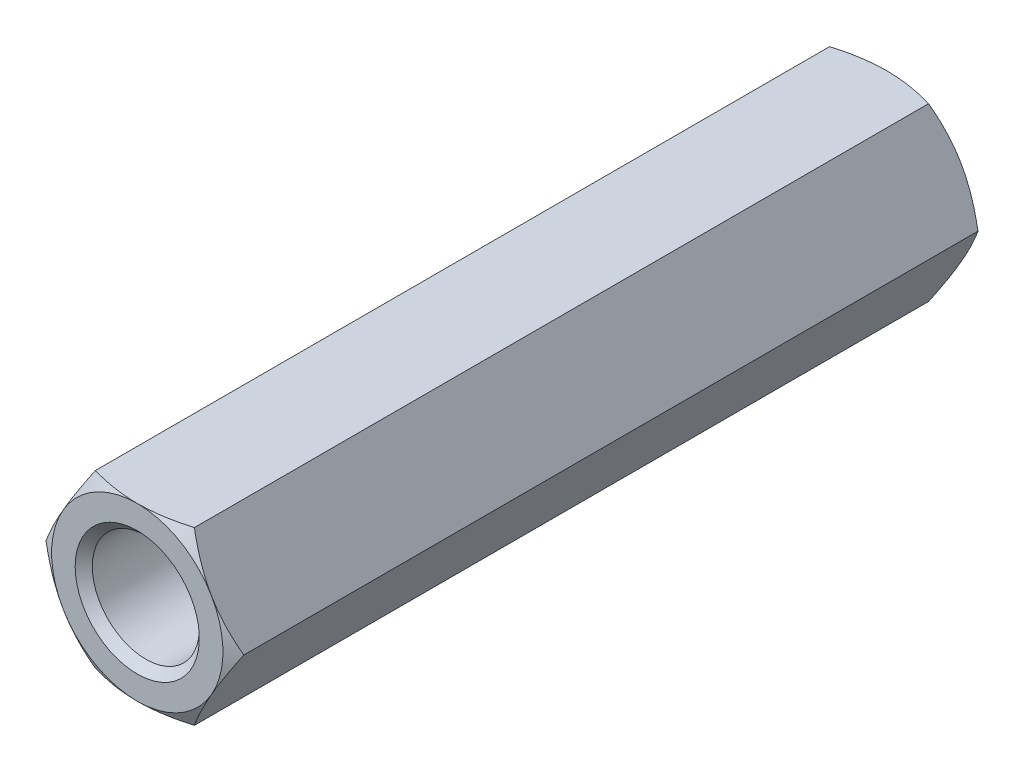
ISO-10303-21;
HEADER;
FILE_DESCRIPTION(('STEP AP214'),'2;1');
FILE_NAME('part.step','',(''),(''),'','','');
FILE_SCHEMA(('AUTOMOTIVE_DESIGN { 1 0 10303 214 1 1 1 1 }'));
ENDSEC;
DATA;
#1=APPLICATION_CONTEXT('core data for automotive mechanical design processes');
#2=APPLICATION_PROTOCOL_DEFINITION('international standard','automotive_design',2000,#1);
#3=PRODUCT_CONTEXT('',#1,'mechanical');
#4=PRODUCT('Part','Part','',(#3));
#5=PRODUCT_RELATED_PRODUCT_CATEGORY('part','',(#4));
#6=PRODUCT_DEFINITION_FORMATION('','',#4);
#7=PRODUCT_DEFINITION_CONTEXT('part definition',#1,'design');
#8=PRODUCT_DEFINITION('design','',#6,#7);
#9=PRODUCT_DEFINITION_SHAPE('','',#8);
#10=(LENGTH_UNIT() NAMED_UNIT(*) SI_UNIT(.MILLI.,.METRE.));
#11=(NAMED_UNIT(*) PLANE_ANGLE_UNIT() SI_UNIT($,.RADIAN.));
#12=(NAMED_UNIT(*) SI_UNIT($,.STERADIAN.) SOLID_ANGLE_UNIT());
#13=UNCERTAINTY_MEASURE_WITH_UNIT(LENGTH_MEASURE(1.E-05),#10,'distance_accuracy_value','');
#14=(GEOMETRIC_REPRESENTATION_CONTEXT(3) GLOBAL_UNCERTAINTY_ASSIGNED_CONTEXT((#13)) GLOBAL_UNIT_ASSIGNED_CONTEXT((#10,
#11,#12)) REPRESENTATION_CONTEXT('',''));
#15=CARTESIAN_POINT('',(0.,0.,0.));
#16=DIRECTION('',(0.,0.,1.));
#17=DIRECTION('',(1.,0.,0.));
#18=AXIS2_PLACEMENT_3D('',#15,#16,#17);
#19=CARTESIAN_POINT('',(4.61880215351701,0.,-17.5));
#20=DIRECTION('',(0.866025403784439,0.5,0.));
#21=DIRECTION('',(-0.5,0.866025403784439,0.));
#22=AXIS2_PLACEMENT_3D('',#19,#20,#21);
#23=PLANE('',#22);
#24=CARTESIAN_POINT('',(4.61891762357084,-0.000199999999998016,17.1426677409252));
#25=CARTESIAN_POINT('',(4.5174314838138,0.17557915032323,17.2012821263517));
#26=CARTESIAN_POINT('',(4.41506932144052,0.352875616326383,17.2545896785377));
#27=CARTESIAN_POINT('',(4.20857250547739,0.710538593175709,17.3476383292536));
#28=CARTESIAN_POINT('',(4.10443418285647,0.890911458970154,17.3873465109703));
#29=CARTESIAN_POINT('',(3.89744813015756,1.24942181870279,17.4491577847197));
#30=CARTESIAN_POINT('',(3.79463224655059,1.42750415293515,17.4716722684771));
#31=CARTESIAN_POINT('',(3.58851671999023,1.78450671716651,17.4985493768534));
#32=CARTESIAN_POINT('',(3.48521782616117,1.9634256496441,17.5029342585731));
#33=CARTESIAN_POINT('',(3.29219970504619,2.29774284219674,17.49380992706));
#34=CARTESIAN_POINT('',(3.20245157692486,2.45319115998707,17.482541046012));
#35=CARTESIAN_POINT('',(3.02354002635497,2.76307505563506,17.4468260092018));
#36=CARTESIAN_POINT('',(2.93437722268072,2.91750956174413,17.4223676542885));
#37=CARTESIAN_POINT('',(2.75509682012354,3.22803232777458,17.3612239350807));
#38=CARTESIAN_POINT('',(2.6650019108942,3.3840812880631,17.3242793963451));
#39=CARTESIAN_POINT('',(2.48615580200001,3.69385183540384,17.240429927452));
#40=CARTESIAN_POINT('',(2.39740231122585,3.84757739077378,17.1935446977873));
#41=CARTESIAN_POINT('',(2.30928560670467,4.0002,17.1426677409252));
#42=B_SPLINE_CURVE_WITH_KNOTS('',3,(#24,#25,#26,#27,#28,#29,#30,#31,#32,#33,#34,#35,#36,#37,#38,
#39,#40,#41),.UNSPECIFIED.,.F.,.F.,(4,2,2,2,2,2,2,2,4),(0.,0.634047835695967,1.26961969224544,
1.88946157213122,2.50854226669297,3.04757825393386,3.58711366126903,4.13861653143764,
4.68903648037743),.UNSPECIFIED.);
#43=CARTESIAN_POINT('',(4.61880215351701,0.,17.1427344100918));
#44=VERTEX_POINT('',#43);
#45=CARTESIAN_POINT('',(3.46410161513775,2.,17.5));
#46=VERTEX_POINT('',#45);
#47=EDGE_CURVE('E171',#44,#46,#42,.T.);
#48=ORIENTED_EDGE('',*,*,#47,.F.);
#49=DIRECTION('',(0.,0.,1.));
#50=VECTOR('',#49,1.);
#51=CARTESIAN_POINT('',(4.61880215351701,0.,-17.5));
#52=LINE('',#51,#50);
#53=CARTESIAN_POINT('',(4.61880215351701,0.,-17.1427344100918));
#54=VERTEX_POINT('',#53);
#55=EDGE_CURVE('E319',#54,#44,#52,.T.);
#56=ORIENTED_EDGE('',*,*,#55,.F.);
#57=CARTESIAN_POINT('',(4.61891762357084,-0.000199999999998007,-17.1426677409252));
#58=CARTESIAN_POINT('',(4.5174314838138,0.17557915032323,-17.2012821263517));
#59=CARTESIAN_POINT('',(4.41506932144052,0.352875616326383,-17.2545896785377));
#60=CARTESIAN_POINT('',(4.20857250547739,0.710538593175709,-17.3476383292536));
#61=CARTESIAN_POINT('',(4.10443418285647,0.890911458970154,-17.3873465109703));
#62=CARTESIAN_POINT('',(3.89744813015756,1.24942181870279,-17.4491577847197));
#63=CARTESIAN_POINT('',(3.79463224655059,1.42750415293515,-17.4716722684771));
#64=CARTESIAN_POINT('',(3.58851671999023,1.78450671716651,-17.4985493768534));
#65=CARTESIAN_POINT('',(3.48521782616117,1.9634256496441,-17.5029342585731));
#66=CARTESIAN_POINT('',(3.29219970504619,2.29774284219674,-17.49380992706));
#67=CARTESIAN_POINT('',(3.20245157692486,2.45319115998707,-17.482541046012));
#68=CARTESIAN_POINT('',(3.02354002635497,2.76307505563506,-17.4468260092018));
#69=CARTESIAN_POINT('',(2.93437722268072,2.91750956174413,-17.4223676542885));
#70=CARTESIAN_POINT('',(2.75509682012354,3.22803232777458,-17.3612239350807));
#71=CARTESIAN_POINT('',(2.6650019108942,3.3840812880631,-17.3242793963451));
#72=CARTESIAN_POINT('',(2.48615580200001,3.69385183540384,-17.240429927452));
#73=CARTESIAN_POINT('',(2.39740231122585,3.84757739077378,-17.1935446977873));
#74=CARTESIAN_POINT('',(2.30928560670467,4.0002,-17.1426677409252));
#75=B_SPLINE_CURVE_WITH_KNOTS('',3,(#57,#58,#59,#60,#61,#62,#63,#64,#65,#66,#67,#68,#69,#70,#71,
#72,#73,#74),.UNSPECIFIED.,.F.,.F.,(4,2,2,2,2,2,2,2,4),(0.,0.634047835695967,1.26961969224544,
1.88946157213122,2.50854226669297,3.04757825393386,3.58711366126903,4.13861653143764,
4.68903648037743),.UNSPECIFIED.);
#76=CARTESIAN_POINT('',(3.46410161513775,2.,-17.5));
#77=VERTEX_POINT('',#76);
#78=EDGE_CURVE('E304',#54,#77,#75,.T.);
#79=ORIENTED_EDGE('',*,*,#78,.T.);
#80=CARTESIAN_POINT('',(2.3094010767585,4.,-17.1427344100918));
#81=VERTEX_POINT('',#80);
#82=EDGE_CURVE('E251',#77,#81,#75,.T.);
#83=ORIENTED_EDGE('',*,*,#82,.T.);
#84=DIRECTION('',(0.,0.,1.));
#85=VECTOR('',#84,1.);
#86=CARTESIAN_POINT('',(2.3094010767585,4.,-17.5));
#87=LINE('',#86,#85);
#88=CARTESIAN_POINT('',(2.3094010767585,4.,17.1427344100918));
#89=VERTEX_POINT('',#88);
#90=EDGE_CURVE('E354',#81,#89,#87,.T.);
#91=ORIENTED_EDGE('',*,*,#90,.T.);
#92=EDGE_CURVE('E147',#46,#89,#42,.T.);
#93=ORIENTED_EDGE('',*,*,#92,.F.);
#94=EDGE_LOOP('',(#48,#56,#79,#83,#91,#93));
#95=FACE_BOUND('',#94,.T.);
#96=ADVANCED_FACE('F41',(#95),#23,.T.);
#97=CARTESIAN_POINT('',(2.3094010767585,-4.,-17.5));
#98=DIRECTION('',(0.866025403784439,-0.5,0.));
#99=DIRECTION('',(0.5,0.866025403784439,0.));
#100=AXIS2_PLACEMENT_3D('',#97,#98,#99);
#101=PLANE('',#100);
#102=CARTESIAN_POINT('',(2.30928560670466,-4.0002,17.1426677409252));
#103=CARTESIAN_POINT('',(2.4107717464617,-3.82442084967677,17.2012821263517));
#104=CARTESIAN_POINT('',(2.51313390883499,-3.64712438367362,17.2545896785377));
#105=CARTESIAN_POINT('',(2.71963072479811,-3.28946140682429,17.3476383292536));
#106=CARTESIAN_POINT('',(2.82376904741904,-3.10908854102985,17.3873465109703));
#107=CARTESIAN_POINT('',(3.03075510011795,-2.75057818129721,17.4491577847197));
#108=CARTESIAN_POINT('',(3.13357098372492,-2.57249584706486,17.4716722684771));
#109=CARTESIAN_POINT('',(3.33968651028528,-2.21549328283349,17.4985493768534));
#110=CARTESIAN_POINT('',(3.44298540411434,-2.0365743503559,17.5029342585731));
#111=CARTESIAN_POINT('',(3.63600352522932,-1.70225715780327,17.49380992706));
#112=CARTESIAN_POINT('',(3.72575165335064,-1.54680884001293,17.482541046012));
#113=CARTESIAN_POINT('',(3.90466320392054,-1.23692494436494,17.4468260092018));
#114=CARTESIAN_POINT('',(3.99382600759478,-1.08249043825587,17.4223676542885));
#115=CARTESIAN_POINT('',(4.17310641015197,-0.77196767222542,17.3612239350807));
#116=CARTESIAN_POINT('',(4.26320131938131,-0.615918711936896,17.3242793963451));
#117=CARTESIAN_POINT('',(4.4420474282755,-0.306148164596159,17.240429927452));
#118=CARTESIAN_POINT('',(4.53080091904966,-0.152422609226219,17.1935446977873));
#119=CARTESIAN_POINT('',(4.61891762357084,0.000200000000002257,17.1426677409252));
#120=B_SPLINE_CURVE_WITH_KNOTS('',3,(#102,#103,#104,#105,#106,#107,#108,#109,#110,#111,#112,
#113,#114,#115,#116,#117,#118,#119),.UNSPECIFIED.,.F.,.F.,(4,2,2,2,2,2,2,2,4),(0.,
0.634047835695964,1.26961969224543,1.88946157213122,2.50854226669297,3.04757825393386,
3.58711366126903,4.13861653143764,4.68903648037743),.UNSPECIFIED.);
#121=CARTESIAN_POINT('',(2.3094010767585,-4.,17.1427344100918));
#122=VERTEX_POINT('',#121);
#123=CARTESIAN_POINT('',(3.46410161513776,-2.,17.5));
#124=VERTEX_POINT('',#123);
#125=EDGE_CURVE('E390',#122,#124,#120,.T.);
#126=ORIENTED_EDGE('',*,*,#125,.F.);
#127=DIRECTION('',(0.,0.,1.));
#128=VECTOR('',#127,1.);
#129=CARTESIAN_POINT('',(2.3094010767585,-4.,-17.5));
#130=LINE('',#129,#128);
#131=CARTESIAN_POINT('',(2.3094010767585,-4.,-17.1427344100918));
#132=VERTEX_POINT('',#131);
#133=EDGE_CURVE('E418',#132,#122,#130,.T.);
#134=ORIENTED_EDGE('',*,*,#133,.F.);
#135=CARTESIAN_POINT('',(2.30928560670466,-4.0002,-17.1426677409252));
#136=CARTESIAN_POINT('',(2.4107717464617,-3.82442084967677,-17.2012821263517));
#137=CARTESIAN_POINT('',(2.51313390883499,-3.64712438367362,-17.2545896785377));
#138=CARTESIAN_POINT('',(2.71963072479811,-3.28946140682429,-17.3476383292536));
#139=CARTESIAN_POINT('',(2.82376904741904,-3.10908854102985,-17.3873465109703));
#140=CARTESIAN_POINT('',(3.03075510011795,-2.75057818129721,-17.4491577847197));
#141=CARTESIAN_POINT('',(3.13357098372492,-2.57249584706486,-17.4716722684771));
#142=CARTESIAN_POINT('',(3.33968651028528,-2.21549328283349,-17.4985493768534));
#143=CARTESIAN_POINT('',(3.44298540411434,-2.0365743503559,-17.5029342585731));
#144=CARTESIAN_POINT('',(3.63600352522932,-1.70225715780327,-17.49380992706));
#145=CARTESIAN_POINT('',(3.72575165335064,-1.54680884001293,-17.482541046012));
#146=CARTESIAN_POINT('',(3.90466320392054,-1.23692494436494,-17.4468260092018));
#147=CARTESIAN_POINT('',(3.99382600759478,-1.08249043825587,-17.4223676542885));
#148=CARTESIAN_POINT('',(4.17310641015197,-0.77196767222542,-17.3612239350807));
#149=CARTESIAN_POINT('',(4.26320131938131,-0.615918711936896,-17.3242793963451));
#150=CARTESIAN_POINT('',(4.4420474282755,-0.306148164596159,-17.240429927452));
#151=CARTESIAN_POINT('',(4.53080091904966,-0.152422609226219,-17.1935446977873));
#152=CARTESIAN_POINT('',(4.61891762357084,0.000200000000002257,-17.1426677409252));
#153=B_SPLINE_CURVE_WITH_KNOTS('',3,(#135,#136,#137,#138,#139,#140,#141,#142,#143,#144,#145,
#146,#147,#148,#149,#150,#151,#152),.UNSPECIFIED.,.F.,.F.,(4,2,2,2,2,2,2,2,4),(0.,
0.634047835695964,1.26961969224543,1.88946157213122,2.50854226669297,3.04757825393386,
3.58711366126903,4.13861653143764,4.68903648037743),.UNSPECIFIED.);
#154=CARTESIAN_POINT('',(3.46410161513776,-2.,-17.5));
#155=VERTEX_POINT('',#154);
#156=EDGE_CURVE('E334',#132,#155,#153,.T.);
#157=ORIENTED_EDGE('',*,*,#156,.T.);
#158=EDGE_CURVE('E248',#155,#54,#153,.T.);
#159=ORIENTED_EDGE('',*,*,#158,.T.);
#160=ORIENTED_EDGE('',*,*,#55,.T.);
#161=EDGE_CURVE('E174',#124,#44,#120,.T.);
#162=ORIENTED_EDGE('',*,*,#161,.F.);
#163=EDGE_LOOP('',(#126,#134,#157,#159,#160,#162));
#164=FACE_BOUND('',#163,.T.);
#165=ADVANCED_FACE('F331',(#164),#101,.T.);
#166=CARTESIAN_POINT('',(-2.3094010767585,-4.,-17.5));
#167=DIRECTION('',(0.,-1.,0.));
#168=DIRECTION('',(0.,0.,-1.));
#169=AXIS2_PLACEMENT_3D('',#166,#167,#168);
#170=PLANE('',#169);
#171=CARTESIAN_POINT('',(-27.9320979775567,-4.,3.51827775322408));
#172=CARTESIAN_POINT('',(-27.3364390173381,-4.,3.85870351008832));
#173=CARTESIAN_POINT('',(-26.7406899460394,-4.,4.19897173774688));
#174=CARTESIAN_POINT('',(-25.548961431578,-4.,4.87910546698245));
#175=CARTESIAN_POINT('',(-24.9529819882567,-4.,5.21897096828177));
#176=CARTESIAN_POINT('',(-23.760713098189,-4.,5.89822837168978));
#177=CARTESIAN_POINT('',(-23.1644236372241,-4.,6.23762024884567));
#178=CARTESIAN_POINT('',(-21.9714949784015,-4.,6.91578846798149));
#179=CARTESIAN_POINT('',(-21.3748557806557,-4.,7.25456481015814));
#180=CARTESIAN_POINT('',(-20.1809681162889,-4.,7.93142811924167));
#181=CARTESIAN_POINT('',(-19.5837195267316,-4.,8.26951486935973));
#182=CARTESIAN_POINT('',(-18.3886470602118,-4.,8.94467002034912));
#183=CARTESIAN_POINT('',(-17.7908231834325,-4.,9.28173842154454));
#184=CARTESIAN_POINT('',(-16.5944328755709,-4.,9.95450718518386));
#185=CARTESIAN_POINT('',(-15.9958664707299,-4.,10.2902075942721));
#186=CARTESIAN_POINT('',(-14.7976952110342,-4.,10.9597491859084));
#187=CARTESIAN_POINT('',(-14.1980903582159,-4.,11.2935903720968));
#188=CARTESIAN_POINT('',(-12.9953141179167,-4.,11.9597884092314));
#189=CARTESIAN_POINT('',(-12.3921375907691,-4.,12.2921359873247));
#190=CARTESIAN_POINT('',(-11.1835804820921,-4.,12.9529113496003));
#191=CARTESIAN_POINT('',(-10.5781997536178,-4.,13.2813388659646));
#192=CARTESIAN_POINT('',(-9.66749658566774,-4.,13.7693152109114));
#193=CARTESIAN_POINT('',(-9.36343912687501,-4.,13.9312231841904));
#194=CARTESIAN_POINT('',(-8.75423738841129,-4.,14.2529793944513));
#195=CARTESIAN_POINT('',(-8.44909311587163,-4.,14.4128276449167));
#196=CARTESIAN_POINT('',(-7.83743436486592,-4.,14.7297955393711));
#197=CARTESIAN_POINT('',(-7.53092005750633,-4.,14.8869155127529));
#198=CARTESIAN_POINT('',(-6.91604122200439,-4.,15.1974806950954));
#199=CARTESIAN_POINT('',(-6.60767673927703,-4.,15.3509259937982));
#200=CARTESIAN_POINT('',(-5.98384223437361,-4.,15.654972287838));
#201=CARTESIAN_POINT('',(-5.66833475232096,-4.,15.8054970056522));
#202=CARTESIAN_POINT('',(-5.1923837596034,-4.,16.0255796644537));
#203=CARTESIAN_POINT('',(-5.03326406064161,-4.,16.0979989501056));
#204=CARTESIAN_POINT('',(-4.7139799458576,-4.,16.2404926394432));
#205=CARTESIAN_POINT('',(-4.55381555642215,-4.,16.3105671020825));
#206=CARTESIAN_POINT('',(-4.23201067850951,-4.,16.447944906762));
#207=CARTESIAN_POINT('',(-4.07036831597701,-4.,16.5152438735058));
#208=CARTESIAN_POINT('',(-3.74564377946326,-4.,16.6462615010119));
#209=CARTESIAN_POINT('',(-3.58256168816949,-4.,16.709980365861));
#210=CARTESIAN_POINT('',(-3.25474481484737,-4.,16.8329470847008));
#211=CARTESIAN_POINT('',(-3.09001035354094,-4.,16.8921957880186));
#212=CARTESIAN_POINT('',(-2.75864603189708,-4.,17.0051036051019));
#213=CARTESIAN_POINT('',(-2.59201636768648,-4.,17.0587632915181));
#214=CARTESIAN_POINT('',(-2.20242057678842,-4.,17.1753553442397));
#215=CARTESIAN_POINT('',(-1.97865804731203,-4.,17.2356766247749));
#216=CARTESIAN_POINT('',(-1.5273371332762,-4.,17.3402426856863));
#217=CARTESIAN_POINT('',(-1.29977976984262,-4.,17.3844917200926));
#218=CARTESIAN_POINT('',(-0.95715107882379,-4.,17.4356516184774));
#219=CARTESIAN_POINT('',(-0.843192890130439,-4.,17.4501407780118));
#220=CARTESIAN_POINT('',(-0.614730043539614,-4.,17.4737868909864));
#221=CARTESIAN_POINT('',(-0.500225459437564,-4.,17.4829445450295));
#222=CARTESIAN_POINT('',(-0.270913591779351,-4.,17.4956472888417));
#223=CARTESIAN_POINT('',(-0.156106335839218,-4.,17.49919287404));
#224=CARTESIAN_POINT('',(0.0735424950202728,-4.,17.5005611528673));
#225=CARTESIAN_POINT('',(0.188384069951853,-4.,17.4983838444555));
#226=CARTESIAN_POINT('',(0.417830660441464,-4.,17.4883742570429));
#227=CARTESIAN_POINT('',(0.532435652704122,-4.,17.4805414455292));
#228=CARTESIAN_POINT('',(0.761151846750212,-4.,17.4594656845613));
#229=CARTESIAN_POINT('',(0.875262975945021,-4.,17.4462219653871));
#230=CARTESIAN_POINT('',(1.21657637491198,-4.,17.3989136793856));
#231=CARTESIAN_POINT('',(1.44275970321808,-4.,17.357271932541));
#232=CARTESIAN_POINT('',(1.78030905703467,-4.,17.2823138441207));
#233=CARTESIAN_POINT('',(1.89310663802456,-4.,17.2550743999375));
#234=CARTESIAN_POINT('',(2.11776468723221,-4.,17.1969399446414));
#235=CARTESIAN_POINT('',(2.2296251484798,-4.,17.1660449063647));
#236=CARTESIAN_POINT('',(2.45240033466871,-4.,17.1010795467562));
#237=CARTESIAN_POINT('',(2.56331515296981,-4.,17.0670095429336));
#238=CARTESIAN_POINT('',(2.7842527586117,-4.,16.9961203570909));
#239=CARTESIAN_POINT('',(2.89427559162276,-4.,16.9593013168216));
#240=CARTESIAN_POINT('',(3.25361466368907,-4.,16.8347303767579));
#241=CARTESIAN_POINT('',(3.50121817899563,-4.,16.7420317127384));
#242=CARTESIAN_POINT('',(3.99300140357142,-4.,16.5479125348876));
#243=CARTESIAN_POINT('',(4.23718015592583,-4.,16.4464896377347));
#244=CARTESIAN_POINT('',(4.72302941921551,-4.,16.2372480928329));
#245=CARTESIAN_POINT('',(4.96469746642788,-4.,16.1294237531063));
#246=CARTESIAN_POINT('',(5.4458709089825,-4.,15.9091423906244));
#247=CARTESIAN_POINT('',(5.68537652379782,-4.,15.7966858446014));
#248=CARTESIAN_POINT('',(6.16333060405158,-4.,15.5679888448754));
#249=CARTESIAN_POINT('',(6.40177473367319,-4.,15.4517393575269));
#250=CARTESIAN_POINT('',(6.87733744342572,-4.,15.2165540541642));
#251=CARTESIAN_POINT('',(7.11445599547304,-4.,15.0976181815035));
#252=CARTESIAN_POINT('',(7.58750918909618,-4.,14.8577170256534));
#253=CARTESIAN_POINT('',(7.82344437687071,-4.,14.7367528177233));
#254=CARTESIAN_POINT('',(8.29445727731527,-4.,14.4931649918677));
#255=CARTESIAN_POINT('',(8.52953498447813,-4.,14.3705413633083));
#256=CARTESIAN_POINT('',(9.23460139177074,-4.,14.0002279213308));
#257=CARTESIAN_POINT('',(9.7035430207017,-4.,13.7505453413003));
#258=CARTESIAN_POINT('',(10.6395734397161,-4.,13.2476072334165));
#259=CARTESIAN_POINT('',(11.1066619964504,-4.,12.9943512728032));
#260=CARTESIAN_POINT('',(12.0387589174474,-4.,12.4857273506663));
#261=CARTESIAN_POINT('',(12.5037693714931,-4.,12.2303632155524));
#262=CARTESIAN_POINT('',(13.4327884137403,-4.,11.7178185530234));
#263=CARTESIAN_POINT('',(13.8967969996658,-4.,11.4606380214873));
#264=CARTESIAN_POINT('',(14.9304936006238,-4.,10.8857212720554));
#265=CARTESIAN_POINT('',(15.4999881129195,-4.,10.5676372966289));
#266=CARTESIAN_POINT('',(16.6381469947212,-4.,9.92997479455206));
#267=CARTESIAN_POINT('',(17.2068113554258,-4.,9.61039625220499));
#268=CARTESIAN_POINT('',(18.9124733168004,-4.,8.6496725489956));
#269=CARTESIAN_POINT('',(20.0485395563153,-4.,8.006874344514));
#270=CARTESIAN_POINT('',(22.3100225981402,-4.,6.72385989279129));
#271=CARTESIAN_POINT('',(23.4354513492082,-4.,6.08366467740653));
#272=CARTESIAN_POINT('',(25.1225624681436,-4.,5.12227445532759));
#273=CARTESIAN_POINT('',(25.6846075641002,-4.,4.80171579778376));
#274=CARTESIAN_POINT('',(26.8084948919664,-4.,4.1602447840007));
#275=CARTESIAN_POINT('',(27.3703371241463,-4.,3.83933242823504));
#276=CARTESIAN_POINT('',(27.9320979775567,-4.,3.51827775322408));
#277=B_SPLINE_CURVE_WITH_KNOTS('',3,(#171,#172,#173,#174,#175,#176,#177,#178,#179,#180,#181,
#182,#183,#184,#185,#186,#187,#188,#189,#190,#191,#192,#193,#194,#195,#196,#197,#198,#199,#200,
#201,#202,#203,#204,#205,#206,#207,#208,#209,#210,#211,#212,#213,#214,#215,#216,#217,#218,#219,
#220,#221,#222,#223,#224,#225,#226,#227,#228,#229,#230,#231,#232,#233,#234,#235,#236,#237,#238,
#239,#240,#241,#242,#243,#244,#245,#246,#247,#248,#249,#250,#251,#252,#253,#254,#255,#256,#257,
#258,#259,#260,#261,#262,#263,#264,#265,#266,#267,#268,#269,#270,#271,#272,#273,#274,#275,#276),
.UNSPECIFIED.,.F.,.F.,(4,2,2,2,2,2,2,2,2,2,2,2,2,2,2,2,2,2,2,2,2,2,2,2,2,2,2,2,2,2,2,2,2,2,2,2,
2,2,2,2,2,2,2,2,2,2,2,2,2,2,2,2,4),(0.,2.05822592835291,4.11645327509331,6.17478524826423,
8.23311656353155,10.2920176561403,12.3509180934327,14.4097477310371,16.4685733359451,
18.5345984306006,20.6007638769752,21.634192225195,22.6676138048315,23.7009097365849,
24.7341804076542,25.7828232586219,26.3072824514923,26.8317284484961,27.3569718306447,
27.8821852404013,28.407298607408,28.9323581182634,29.6271751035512,30.3218080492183,
30.6663288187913,31.0108043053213,31.355249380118,31.6996945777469,32.0441722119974,
32.3886988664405,33.0777490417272,33.4258303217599,33.7739141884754,34.1219632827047,
34.4699944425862,35.2628858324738,36.0559945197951,36.8498192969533,37.6435625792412,
38.4393586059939,39.2351714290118,40.0305749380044,40.8259835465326,42.4197663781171,
44.0137439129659,45.6052814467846,47.1968225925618,49.1537333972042,51.1106648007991,
55.0265898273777,58.9109102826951,60.8520111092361,62.7931093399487),.UNSPECIFIED.);
#278=CARTESIAN_POINT('',(-2.3094010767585,-4.,17.1427344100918));
#279=VERTEX_POINT('',#278);
#280=CARTESIAN_POINT('',(0.,-4.,17.5));
#281=VERTEX_POINT('',#280);
#282=EDGE_CURVE('E409',#279,#281,#277,.T.);
#283=ORIENTED_EDGE('',*,*,#282,.F.);
#284=DIRECTION('',(0.,0.,1.));
#285=VECTOR('',#284,1.);
#286=CARTESIAN_POINT('',(-2.3094010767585,-4.,-17.5));
#287=LINE('',#286,#285);
#288=CARTESIAN_POINT('',(-2.3094010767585,-4.,-17.1427344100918));
#289=VERTEX_POINT('',#288);
#290=EDGE_CURVE('E419',#289,#279,#287,.T.);
#291=ORIENTED_EDGE('',*,*,#290,.F.);
#292=CARTESIAN_POINT('',(-16.1638911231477,-4.,-10.1956717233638));
#293=CARTESIAN_POINT('',(-15.8103613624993,-4.,-10.393796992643));
#294=CARTESIAN_POINT('',(-15.4566783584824,-4.,-10.5916495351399));
#295=CARTESIAN_POINT('',(-14.7489214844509,-4.,-10.986658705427));
#296=CARTESIAN_POINT('',(-14.3948476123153,-4.,-11.1838153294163));
#297=CARTESIAN_POINT('',(-13.6861394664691,-4.,-11.5773294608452));
#298=CARTESIAN_POINT('',(-13.3315050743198,-4.,-11.7736867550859));
#299=CARTESIAN_POINT('',(-12.6216503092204,-4.,-12.1653378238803));
#300=CARTESIAN_POINT('',(-12.2664299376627,-4.,-12.3606316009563));
#301=CARTESIAN_POINT('',(-11.5563279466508,-4.,-12.7492791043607));
#302=CARTESIAN_POINT('',(-11.2014485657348,-4.,-12.9426369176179));
#303=CARTESIAN_POINT('',(-10.490748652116,-4.,-13.3276145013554));
#304=CARTESIAN_POINT('',(-10.1349281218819,-4.,-13.5192342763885));
#305=CARTESIAN_POINT('',(-9.42210042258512,-4.,-13.9001503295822));
#306=CARTESIAN_POINT('',(-9.06509340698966,-4.,-14.0894468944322));
#307=CARTESIAN_POINT('',(-8.34944008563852,-4.,-14.464908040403));
#308=CARTESIAN_POINT('',(-7.99079380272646,-4.,-14.651072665));
#309=CARTESIAN_POINT('',(-7.27431988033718,-4.,-15.0174581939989));
#310=CARTESIAN_POINT('',(-6.91651133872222,-4.,-15.1977162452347));
#311=CARTESIAN_POINT('',(-6.37743828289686,-4.,-15.4634047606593));
#312=CARTESIAN_POINT('',(-6.1973362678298,-4.,-15.5511928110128));
#313=CARTESIAN_POINT('',(-5.83620019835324,-4.,-15.7248280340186));
#314=CARTESIAN_POINT('',(-5.65516615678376,-4.,-15.8106752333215));
#315=CARTESIAN_POINT('',(-5.29097504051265,-4.,-15.9804408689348));
#316=CARTESIAN_POINT('',(-5.10781176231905,-4.,-16.0643460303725));
#317=CARTESIAN_POINT('',(-4.74012561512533,-4.,-16.2291149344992));
#318=CARTESIAN_POINT('',(-4.55560279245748,-4.,-16.3099787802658));
#319=CARTESIAN_POINT('',(-4.18494082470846,-4.,-16.4678414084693));
#320=CARTESIAN_POINT('',(-3.99880196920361,-4.,-16.5448408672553));
#321=CARTESIAN_POINT('',(-3.62456432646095,-4.,-16.6938956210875));
#322=CARTESIAN_POINT('',(-3.43646568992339,-4.,-16.7659512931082));
#323=CARTESIAN_POINT('',(-3.01251949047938,-4.,-16.9202252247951));
#324=CARTESIAN_POINT('',(-2.77604041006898,-4.,-17.0007356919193));
#325=CARTESIAN_POINT('',(-2.29884326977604,-4.,-17.1483180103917));
#326=CARTESIAN_POINT('',(-2.05812497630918,-4.,-17.2153891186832));
#327=CARTESIAN_POINT('',(-1.57503996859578,-4.,-17.3306138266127));
#328=CARTESIAN_POINT('',(-1.33272647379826,-4.,-17.3789819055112));
#329=CARTESIAN_POINT('',(-0.966735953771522,-4.,-17.4344847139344));
#330=CARTESIAN_POINT('',(-0.844332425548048,-4.,-17.4501433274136));
#331=CARTESIAN_POINT('',(-0.598883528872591,-4.,-17.4752992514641));
#332=CARTESIAN_POINT('',(-0.475838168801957,-4.,-17.4847966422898));
#333=CARTESIAN_POINT('',(-0.227708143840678,-4.,-17.4973769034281));
#334=CARTESIAN_POINT('',(-0.102618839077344,-4.,-17.5003691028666));
#335=CARTESIAN_POINT('',(0.14753779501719,-4.,-17.4995580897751));
#336=CARTESIAN_POINT('',(0.272605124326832,-4.,-17.4957548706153));
#337=CARTESIAN_POINT('',(0.522378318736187,-4.,-17.4814958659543));
#338=CARTESIAN_POINT('',(0.647084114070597,-4.,-17.4710388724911));
#339=CARTESIAN_POINT('',(0.895804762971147,-4.,-17.443846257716));
#340=CARTESIAN_POINT('',(1.01981959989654,-4.,-17.4271104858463));
#341=CARTESIAN_POINT('',(1.26837744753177,-4.,-17.3876710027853));
#342=CARTESIAN_POINT('',(1.39290963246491,-4.,-17.3648996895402));
#343=CARTESIAN_POINT('',(1.64089711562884,-4.,-17.3141324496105));
#344=CARTESIAN_POINT('',(1.76435239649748,-4.,-17.286136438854));
#345=CARTESIAN_POINT('',(2.0101619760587,-4.,-17.2255804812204));
#346=CARTESIAN_POINT('',(2.13251600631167,-4.,-17.1930194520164));
#347=CARTESIAN_POINT('',(2.3760962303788,-4.,-17.1239721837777));
#348=CARTESIAN_POINT('',(2.49732248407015,-4.,-17.087486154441));
#349=CARTESIAN_POINT('',(2.83955613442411,-4.,-16.9792868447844));
#350=CARTESIAN_POINT('',(3.05931068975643,-4.,-16.9036098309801));
#351=CARTESIAN_POINT('',(3.49577932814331,-4.,-16.743894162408));
#352=CARTESIAN_POINT('',(3.71249253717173,-4.,-16.6598531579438));
#353=CARTESIAN_POINT('',(4.14359629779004,-4.,-16.4854612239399));
#354=CARTESIAN_POINT('',(4.35798437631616,-4.,-16.3951042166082));
#355=CARTESIAN_POINT('',(4.78468578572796,-4.,-16.2097019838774));
#356=CARTESIAN_POINT('',(4.99699932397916,-4.,-16.1146572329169));
#357=CARTESIAN_POINT('',(5.42055228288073,-4.,-15.9207116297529));
#358=CARTESIAN_POINT('',(5.63178719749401,-4.,-15.8218009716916));
#359=CARTESIAN_POINT('',(6.05292200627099,-4.,-15.6211744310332));
#360=CARTESIAN_POINT('',(6.26282187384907,-4.,-15.5194584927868));
#361=CARTESIAN_POINT('',(6.68141909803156,-4.,-15.3138750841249));
#362=CARTESIAN_POINT('',(6.8901170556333,-4.,-15.2100088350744));
#363=CARTESIAN_POINT('',(7.30662459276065,-4.,-15.000508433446));
#364=CARTESIAN_POINT('',(7.51443416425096,-4.,-14.8948742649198));
#365=CARTESIAN_POINT('',(8.13790287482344,-4.,-14.5752624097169));
#366=CARTESIAN_POINT('',(8.55246214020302,-4.,-14.359140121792));
#367=CARTESIAN_POINT('',(9.37959300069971,-4.,-13.9230164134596));
#368=CARTESIAN_POINT('',(9.79216433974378,-4.,-13.7030145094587));
#369=CARTESIAN_POINT('',(10.6152158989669,-4.,-13.2606020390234));
#370=CARTESIAN_POINT('',(11.025698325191,-4.,-13.0381955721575));
#371=CARTESIAN_POINT('',(11.8455737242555,-4.,-12.5913835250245));
#372=CARTESIAN_POINT('',(12.2549666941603,-4.,-12.3669779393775));
#373=CARTESIAN_POINT('',(12.9568369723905,-4.,-11.9805680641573));
#374=CARTESIAN_POINT('',(13.2495167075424,-4.,-11.8189311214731));
#375=CARTESIAN_POINT('',(13.8346058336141,-4.,-11.4949669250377));
#376=CARTESIAN_POINT('',(14.1270151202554,-4.,-11.3326394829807));
#377=CARTESIAN_POINT('',(14.7103549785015,-4.,-11.0081041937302));
#378=CARTESIAN_POINT('',(15.0012867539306,-4.,-10.845898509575));
#379=CARTESIAN_POINT('',(15.5828110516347,-4.,-10.521081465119));
#380=CARTESIAN_POINT('',(15.8734036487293,-4.,-10.3584702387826));
#381=CARTESIAN_POINT('',(16.1638911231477,-4.,-10.1956717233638));
#382=B_SPLINE_CURVE_WITH_KNOTS('',3,(#292,#293,#294,#295,#296,#297,#298,#299,#300,#301,#302,
#303,#304,#305,#306,#307,#308,#309,#310,#311,#312,#313,#314,#315,#316,#317,#318,#319,#320,#321,
#322,#323,#324,#325,#326,#327,#328,#329,#330,#331,#332,#333,#334,#335,#336,#337,#338,#339,#340,
#341,#342,#343,#344,#345,#346,#347,#348,#349,#350,#351,#352,#353,#354,#355,#356,#357,#358,#359,
#360,#361,#362,#363,#364,#365,#366,#367,#368,#369,#370,#371,#372,#373,#374,#375,#376,#377,#378,
#379,#380,#381),.UNSPECIFIED.,.F.,.F.,(4,2,2,2,2,2,2,2,2,2,2,2,2,2,2,2,2,2,2,2,2,2,2,2,2,2,2,2,
2,2,2,2,2,2,2,2,2,2,2,2,2,2,2,2,4),(0.,1.21578501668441,2.43157666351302,3.64767374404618,
4.86376793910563,6.07617487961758,7.28857864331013,8.50083125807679,9.71306703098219,
10.9149657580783,11.5160319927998,12.1170899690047,12.7214683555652,13.3258262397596,
13.9300779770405,14.5342835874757,15.2834096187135,16.0325770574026,16.772878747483,
17.142949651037,17.5130157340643,17.8882076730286,18.2633999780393,18.6386604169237,
19.0139298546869,19.3935945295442,19.7732653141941,20.1530262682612,20.5327669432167,
21.2297689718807,21.9269673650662,22.6248461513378,23.3226544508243,24.022365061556,
24.7220895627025,25.4214269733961,26.1207706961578,27.5232740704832,28.9259535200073,
30.3265328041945,31.7271158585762,32.730156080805,33.7334900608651,34.7327733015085,
35.7317614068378),.UNSPECIFIED.);
#383=CARTESIAN_POINT('',(0.,-4.,-17.5));
#384=VERTEX_POINT('',#383);
#385=EDGE_CURVE('E348',#289,#384,#382,.T.);
#386=ORIENTED_EDGE('',*,*,#385,.T.);
#387=EDGE_CURVE('E276',#384,#132,#382,.T.);
#388=ORIENTED_EDGE('',*,*,#387,.T.);
#389=ORIENTED_EDGE('',*,*,#133,.T.);
#390=EDGE_CURVE('E210',#281,#122,#277,.T.);
#391=ORIENTED_EDGE('',*,*,#390,.F.);
#392=EDGE_LOOP('',(#283,#291,#386,#388,#389,#391));
#393=FACE_BOUND('',#392,.T.);
#394=ADVANCED_FACE('F233',(#393),#170,.T.);
#395=CARTESIAN_POINT('',(-4.61880215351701,0.,-17.5));
#396=DIRECTION('',(-0.866025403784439,-0.5,0.));
#397=DIRECTION('',(0.5,-0.866025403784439,0.));
#398=AXIS2_PLACEMENT_3D('',#395,#396,#397);
#399=PLANE('',#398);
#400=CARTESIAN_POINT('',(-4.61891762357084,0.000200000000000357,17.1426677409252));
#401=CARTESIAN_POINT('',(-4.5174314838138,-0.175579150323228,17.2012821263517));
#402=CARTESIAN_POINT('',(-4.41506932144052,-0.352875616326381,17.2545896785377));
#403=CARTESIAN_POINT('',(-4.20857250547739,-0.710538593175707,17.3476383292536));
#404=CARTESIAN_POINT('',(-4.10443418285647,-0.890911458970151,17.3873465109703));
#405=CARTESIAN_POINT('',(-3.89744813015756,-1.24942181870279,17.4491577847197));
#406=CARTESIAN_POINT('',(-3.79463224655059,-1.42750415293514,17.4716722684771));
#407=CARTESIAN_POINT('',(-3.58851671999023,-1.78450671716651,17.4985493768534));
#408=CARTESIAN_POINT('',(-3.48521782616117,-1.9634256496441,17.5029342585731));
#409=CARTESIAN_POINT('',(-3.29219970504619,-2.29774284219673,17.49380992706));
#410=CARTESIAN_POINT('',(-3.20245157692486,-2.45319115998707,17.482541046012));
#411=CARTESIAN_POINT('',(-3.02354002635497,-2.76307505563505,17.4468260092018));
#412=CARTESIAN_POINT('',(-2.93437722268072,-2.91750956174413,17.4223676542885));
#413=CARTESIAN_POINT('',(-2.75509682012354,-3.22803232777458,17.3612239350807));
#414=CARTESIAN_POINT('',(-2.6650019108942,-3.3840812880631,17.3242793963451));
#415=CARTESIAN_POINT('',(-2.48615580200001,-3.69385183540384,17.240429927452));
#416=CARTESIAN_POINT('',(-2.39740231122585,-3.84757739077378,17.1935446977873));
#417=CARTESIAN_POINT('',(-2.30928560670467,-4.0002,17.1426677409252));
#418=B_SPLINE_CURVE_WITH_KNOTS('',3,(#400,#401,#402,#403,#404,#405,#406,#407,#408,#409,#410,
#411,#412,#413,#414,#415,#416,#417),.UNSPECIFIED.,.F.,.F.,(4,2,2,2,2,2,2,2,4),(0.,
0.634047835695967,1.26961969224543,1.88946157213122,2.50854226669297,3.04757825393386,
3.58711366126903,4.13861653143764,4.68903648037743),.UNSPECIFIED.);
#419=CARTESIAN_POINT('',(-4.61880215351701,0.,17.1427344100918));
#420=VERTEX_POINT('',#419);
#421=CARTESIAN_POINT('',(-3.46410161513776,-2.,17.5));
#422=VERTEX_POINT('',#421);
#423=EDGE_CURVE('E156',#420,#422,#418,.T.);
#424=ORIENTED_EDGE('',*,*,#423,.F.);
#425=DIRECTION('',(0.,0.,1.));
#426=VECTOR('',#425,1.);
#427=CARTESIAN_POINT('',(-4.61880215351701,0.,-17.5));
#428=LINE('',#427,#426);
#429=CARTESIAN_POINT('',(-4.61880215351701,0.,-17.1427344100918));
#430=VERTEX_POINT('',#429);
#431=EDGE_CURVE('E169',#430,#420,#428,.T.);
#432=ORIENTED_EDGE('',*,*,#431,.F.);
#433=CARTESIAN_POINT('',(-4.61891762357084,0.000200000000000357,-17.1426677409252));
#434=CARTESIAN_POINT('',(-4.5174314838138,-0.175579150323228,-17.2012821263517));
#435=CARTESIAN_POINT('',(-4.41506932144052,-0.352875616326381,-17.2545896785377));
#436=CARTESIAN_POINT('',(-4.20857250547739,-0.710538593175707,-17.3476383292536));
#437=CARTESIAN_POINT('',(-4.10443418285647,-0.890911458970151,-17.3873465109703));
#438=CARTESIAN_POINT('',(-3.89744813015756,-1.24942181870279,-17.4491577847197));
#439=CARTESIAN_POINT('',(-3.79463224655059,-1.42750415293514,-17.4716722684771));
#440=CARTESIAN_POINT('',(-3.58851671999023,-1.78450671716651,-17.4985493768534));
#441=CARTESIAN_POINT('',(-3.48521782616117,-1.9634256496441,-17.5029342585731));
#442=CARTESIAN_POINT('',(-3.29219970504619,-2.29774284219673,-17.49380992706));
#443=CARTESIAN_POINT('',(-3.20245157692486,-2.45319115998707,-17.482541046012));
#444=CARTESIAN_POINT('',(-3.02354002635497,-2.76307505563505,-17.4468260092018));
#445=CARTESIAN_POINT('',(-2.93437722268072,-2.91750956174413,-17.4223676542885));
#446=CARTESIAN_POINT('',(-2.75509682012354,-3.22803232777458,-17.3612239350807));
#447=CARTESIAN_POINT('',(-2.6650019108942,-3.3840812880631,-17.3242793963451));
#448=CARTESIAN_POINT('',(-2.48615580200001,-3.69385183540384,-17.240429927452));
#449=CARTESIAN_POINT('',(-2.39740231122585,-3.84757739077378,-17.1935446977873));
#450=CARTESIAN_POINT('',(-2.30928560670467,-4.0002,-17.1426677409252));
#451=B_SPLINE_CURVE_WITH_KNOTS('',3,(#433,#434,#435,#436,#437,#438,#439,#440,#441,#442,#443,
#444,#445,#446,#447,#448,#449,#450),.UNSPECIFIED.,.F.,.F.,(4,2,2,2,2,2,2,2,4),(0.,
0.634047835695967,1.26961969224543,1.88946157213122,2.50854226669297,3.04757825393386,
3.58711366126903,4.13861653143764,4.68903648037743),.UNSPECIFIED.);
#452=CARTESIAN_POINT('',(-3.46410161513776,-2.,-17.5));
#453=VERTEX_POINT('',#452);
#454=EDGE_CURVE('E238',#430,#453,#451,.T.);
#455=ORIENTED_EDGE('',*,*,#454,.T.);
#456=EDGE_CURVE('E250',#453,#289,#451,.T.);
#457=ORIENTED_EDGE('',*,*,#456,.T.);
#458=ORIENTED_EDGE('',*,*,#290,.T.);
#459=EDGE_CURVE('E176',#422,#279,#418,.T.);
#460=ORIENTED_EDGE('',*,*,#459,.F.);
#461=EDGE_LOOP('',(#424,#432,#455,#457,#458,#460));
#462=FACE_BOUND('',#461,.T.);
#463=ADVANCED_FACE('F230',(#462),#399,.T.);
#464=CARTESIAN_POINT('',(-2.3094010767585,4.,-17.5));
#465=DIRECTION('',(-0.866025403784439,0.5,0.));
#466=DIRECTION('',(-0.5,-0.866025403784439,0.));
#467=AXIS2_PLACEMENT_3D('',#464,#465,#466);
#468=PLANE('',#467);
#469=CARTESIAN_POINT('',(-2.30928560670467,4.0002,17.1426677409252));
#470=CARTESIAN_POINT('',(-2.41077174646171,3.82442084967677,17.2012821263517));
#471=CARTESIAN_POINT('',(-2.513133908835,3.64712438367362,17.2545896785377));
#472=CARTESIAN_POINT('',(-2.71963072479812,3.28946140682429,17.3476383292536));
#473=CARTESIAN_POINT('',(-2.82376904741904,3.10908854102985,17.3873465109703));
#474=CARTESIAN_POINT('',(-3.03075510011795,2.75057818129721,17.4491577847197));
#475=CARTESIAN_POINT('',(-3.13357098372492,2.57249584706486,17.4716722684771));
#476=CARTESIAN_POINT('',(-3.33968651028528,2.21549328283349,17.4985493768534));
#477=CARTESIAN_POINT('',(-3.44298540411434,2.0365743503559,17.5029342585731));
#478=CARTESIAN_POINT('',(-3.63600352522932,1.70225715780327,17.49380992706));
#479=CARTESIAN_POINT('',(-3.72575165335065,1.54680884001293,17.482541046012));
#480=CARTESIAN_POINT('',(-3.90466320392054,1.23692494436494,17.4468260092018));
#481=CARTESIAN_POINT('',(-3.99382600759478,1.08249043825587,17.4223676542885));
#482=CARTESIAN_POINT('',(-4.17310641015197,0.771967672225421,17.3612239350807));
#483=CARTESIAN_POINT('',(-4.26320131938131,0.615918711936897,17.3242793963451));
#484=CARTESIAN_POINT('',(-4.4420474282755,0.30614816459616,17.240429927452));
#485=CARTESIAN_POINT('',(-4.53080091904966,0.15242260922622,17.1935446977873));
#486=CARTESIAN_POINT('',(-4.61891762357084,-0.000200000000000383,17.1426677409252));
#487=B_SPLINE_CURVE_WITH_KNOTS('',3,(#469,#470,#471,#472,#473,#474,#475,#476,#477,#478,#479,
#480,#481,#482,#483,#484,#485,#486),.UNSPECIFIED.,.F.,.F.,(4,2,2,2,2,2,2,2,4),(0.,
0.634047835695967,1.26961969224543,1.88946157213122,2.50854226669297,3.04757825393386,
3.58711366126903,4.13861653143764,4.68903648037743),.UNSPECIFIED.);
#488=CARTESIAN_POINT('',(-2.3094010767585,4.,17.1427344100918));
#489=VERTEX_POINT('',#488);
#490=CARTESIAN_POINT('',(-3.46410161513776,2.,17.5));
#491=VERTEX_POINT('',#490);
#492=EDGE_CURVE('E135',#489,#491,#487,.T.);
#493=ORIENTED_EDGE('',*,*,#492,.F.);
#494=DIRECTION('',(0.,0.,1.));
#495=VECTOR('',#494,1.);
#496=CARTESIAN_POINT('',(-2.3094010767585,4.,-17.5));
#497=LINE('',#496,#495);
#498=CARTESIAN_POINT('',(-2.3094010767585,4.,-17.1427344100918));
#499=VERTEX_POINT('',#498);
#500=EDGE_CURVE('E356',#499,#489,#497,.T.);
#501=ORIENTED_EDGE('',*,*,#500,.F.);
#502=CARTESIAN_POINT('',(-2.30928560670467,4.0002,-17.1426677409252));
#503=CARTESIAN_POINT('',(-2.41077174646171,3.82442084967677,-17.2012821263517));
#504=CARTESIAN_POINT('',(-2.513133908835,3.64712438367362,-17.2545896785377));
#505=CARTESIAN_POINT('',(-2.71963072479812,3.28946140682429,-17.3476383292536));
#506=CARTESIAN_POINT('',(-2.82376904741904,3.10908854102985,-17.3873465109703));
#507=CARTESIAN_POINT('',(-3.03075510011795,2.75057818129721,-17.4491577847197));
#508=CARTESIAN_POINT('',(-3.13357098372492,2.57249584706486,-17.4716722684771));
#509=CARTESIAN_POINT('',(-3.33968651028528,2.21549328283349,-17.4985493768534));
#510=CARTESIAN_POINT('',(-3.44298540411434,2.0365743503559,-17.5029342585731));
#511=CARTESIAN_POINT('',(-3.63600352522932,1.70225715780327,-17.49380992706));
#512=CARTESIAN_POINT('',(-3.72575165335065,1.54680884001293,-17.482541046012));
#513=CARTESIAN_POINT('',(-3.90466320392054,1.23692494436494,-17.4468260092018));
#514=CARTESIAN_POINT('',(-3.99382600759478,1.08249043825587,-17.4223676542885));
#515=CARTESIAN_POINT('',(-4.17310641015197,0.771967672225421,-17.3612239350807));
#516=CARTESIAN_POINT('',(-4.26320131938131,0.615918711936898,-17.3242793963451));
#517=CARTESIAN_POINT('',(-4.4420474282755,0.306148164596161,-17.240429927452));
#518=CARTESIAN_POINT('',(-4.53080091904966,0.152422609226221,-17.1935446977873));
#519=CARTESIAN_POINT('',(-4.61891762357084,-0.000199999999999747,-17.1426677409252));
#520=B_SPLINE_CURVE_WITH_KNOTS('',3,(#502,#503,#504,#505,#506,#507,#508,#509,#510,#511,#512,
#513,#514,#515,#516,#517,#518,#519),.UNSPECIFIED.,.F.,.F.,(4,2,2,2,2,2,2,2,4),(0.,
0.634047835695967,1.26961969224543,1.88946157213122,2.50854226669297,3.04757825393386,
3.58711366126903,4.13861653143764,4.68903648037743),.UNSPECIFIED.);
#521=CARTESIAN_POINT('',(-3.46410161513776,2.,-17.5));
#522=VERTEX_POINT('',#521);
#523=EDGE_CURVE('E292',#499,#522,#520,.T.);
#524=ORIENTED_EDGE('',*,*,#523,.T.);
#525=EDGE_CURVE('E249',#522,#430,#520,.T.);
#526=ORIENTED_EDGE('',*,*,#525,.T.);
#527=ORIENTED_EDGE('',*,*,#431,.T.);
#528=EDGE_CURVE('E150',#491,#420,#487,.T.);
#529=ORIENTED_EDGE('',*,*,#528,.F.);
#530=EDGE_LOOP('',(#493,#501,#524,#526,#527,#529));
#531=FACE_BOUND('',#530,.T.);
#532=ADVANCED_FACE('F166',(#531),#468,.T.);
#533=CARTESIAN_POINT('',(2.3094010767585,4.,-17.5));
#534=DIRECTION('',(0.,1.,0.));
#535=DIRECTION('',(0.,0.,1.));
#536=AXIS2_PLACEMENT_3D('',#533,#534,#535);
#537=PLANE('',#536);
#538=CARTESIAN_POINT('',(27.9320979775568,4.,3.51827775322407));
#539=CARTESIAN_POINT('',(27.3364390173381,4.,3.85870351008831));
#540=CARTESIAN_POINT('',(26.7406899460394,4.,4.19897173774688));
#541=CARTESIAN_POINT('',(25.548961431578,4.,4.87910546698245));
#542=CARTESIAN_POINT('',(24.9529819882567,4.,5.21897096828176));
#543=CARTESIAN_POINT('',(23.760713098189,4.,5.89822837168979));
#544=CARTESIAN_POINT('',(23.1644236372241,4.,6.23762024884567));
#545=CARTESIAN_POINT('',(21.9714949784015,4.,6.9157884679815));
#546=CARTESIAN_POINT('',(21.3748557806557,4.,7.25456481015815));
#547=CARTESIAN_POINT('',(20.1809681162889,4.,7.93142811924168));
#548=CARTESIAN_POINT('',(19.5837195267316,4.,8.26951486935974));
#549=CARTESIAN_POINT('',(18.3886470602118,4.,8.94467002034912));
#550=CARTESIAN_POINT('',(17.7908231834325,4.,9.28173842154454));
#551=CARTESIAN_POINT('',(16.5944328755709,4.,9.95450718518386));
#552=CARTESIAN_POINT('',(15.9958664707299,4.,10.2902075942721));
#553=CARTESIAN_POINT('',(14.7976952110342,4.,10.9597491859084));
#554=CARTESIAN_POINT('',(14.1980903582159,4.,11.2935903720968));
#555=CARTESIAN_POINT('',(12.9953141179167,4.,11.9597884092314));
#556=CARTESIAN_POINT('',(12.3921375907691,4.,12.2921359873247));
#557=CARTESIAN_POINT('',(11.1835804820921,4.,12.9529113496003));
#558=CARTESIAN_POINT('',(10.5781997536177,4.,13.2813388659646));
#559=CARTESIAN_POINT('',(9.66749658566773,4.,13.7693152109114));
#560=CARTESIAN_POINT('',(9.36343912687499,4.,13.9312231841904));
#561=CARTESIAN_POINT('',(8.75423738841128,4.,14.2529793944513));
#562=CARTESIAN_POINT('',(8.44909311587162,4.,14.4128276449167));
#563=CARTESIAN_POINT('',(7.83743436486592,4.,14.7297955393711));
#564=CARTESIAN_POINT('',(7.53092005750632,4.,14.8869155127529));
#565=CARTESIAN_POINT('',(6.91604122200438,4.,15.1974806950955));
#566=CARTESIAN_POINT('',(6.60767673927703,4.,15.3509259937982));
#567=CARTESIAN_POINT('',(5.98384223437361,4.,15.6549722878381));
#568=CARTESIAN_POINT('',(5.66833475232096,4.,15.8054970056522));
#569=CARTESIAN_POINT('',(5.1923837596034,4.,16.0255796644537));
#570=CARTESIAN_POINT('',(5.0332640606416,4.,16.0979989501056));
#571=CARTESIAN_POINT('',(4.7139799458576,4.,16.2404926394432));
#572=CARTESIAN_POINT('',(4.55381555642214,4.,16.3105671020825));
#573=CARTESIAN_POINT('',(4.2320106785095,4.,16.447944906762));
#574=CARTESIAN_POINT('',(4.070368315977,4.,16.5152438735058));
#575=CARTESIAN_POINT('',(3.74564377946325,4.,16.6462615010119));
#576=CARTESIAN_POINT('',(3.58256168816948,4.,16.709980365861));
#577=CARTESIAN_POINT('',(3.25474481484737,4.,16.8329470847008));
#578=CARTESIAN_POINT('',(3.09001035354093,4.,16.8921957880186));
#579=CARTESIAN_POINT('',(2.75864603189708,4.,17.0051036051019));
#580=CARTESIAN_POINT('',(2.59201636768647,4.,17.0587632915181));
#581=CARTESIAN_POINT('',(2.20242057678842,4.,17.1753553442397));
#582=CARTESIAN_POINT('',(1.97865804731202,4.,17.2356766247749));
#583=CARTESIAN_POINT('',(1.52733713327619,4.,17.3402426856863));
#584=CARTESIAN_POINT('',(1.29977976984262,4.,17.3844917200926));
#585=CARTESIAN_POINT('',(0.957151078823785,4.,17.4356516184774));
#586=CARTESIAN_POINT('',(0.843192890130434,4.,17.4501407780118));
#587=CARTESIAN_POINT('',(0.614730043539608,4.,17.4737868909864));
#588=CARTESIAN_POINT('',(0.500225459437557,4.,17.4829445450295));
#589=CARTESIAN_POINT('',(0.27091359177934,4.,17.4956472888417));
#590=CARTESIAN_POINT('',(0.156106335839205,4.,17.49919287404));
#591=CARTESIAN_POINT('',(-0.0735424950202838,4.,17.5005611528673));
#592=CARTESIAN_POINT('',(-0.188384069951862,4.,17.4983838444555));
#593=CARTESIAN_POINT('',(-0.417830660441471,4.,17.4883742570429));
#594=CARTESIAN_POINT('',(-0.532435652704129,4.,17.4805414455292));
#595=CARTESIAN_POINT('',(-0.76115184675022,4.,17.4594656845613));
#596=CARTESIAN_POINT('',(-0.875262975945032,4.,17.4462219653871));
#597=CARTESIAN_POINT('',(-1.216576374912,4.,17.3989136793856));
#598=CARTESIAN_POINT('',(-1.44275970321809,4.,17.357271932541));
#599=CARTESIAN_POINT('',(-1.78030905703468,4.,17.2823138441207));
#600=CARTESIAN_POINT('',(-1.89310663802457,4.,17.2550743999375));
#601=CARTESIAN_POINT('',(-2.11776468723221,4.,17.1969399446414));
#602=CARTESIAN_POINT('',(-2.2296251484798,4.,17.1660449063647));
#603=CARTESIAN_POINT('',(-2.45240033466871,4.,17.1010795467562));
#604=CARTESIAN_POINT('',(-2.56331515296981,4.,17.0670095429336));
#605=CARTESIAN_POINT('',(-2.78425275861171,4.,16.9961203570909));
#606=CARTESIAN_POINT('',(-2.89427559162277,4.,16.9593013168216));
#607=CARTESIAN_POINT('',(-3.25361466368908,4.,16.8347303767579));
#608=CARTESIAN_POINT('',(-3.50121817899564,4.,16.7420317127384));
#609=CARTESIAN_POINT('',(-3.99300140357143,4.,16.5479125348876));
#610=CARTESIAN_POINT('',(-4.23718015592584,4.,16.4464896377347));
#611=CARTESIAN_POINT('',(-4.72302941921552,4.,16.2372480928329));
#612=CARTESIAN_POINT('',(-4.96469746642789,4.,16.1294237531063));
#613=CARTESIAN_POINT('',(-5.44587090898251,4.,15.9091423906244));
#614=CARTESIAN_POINT('',(-5.68537652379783,4.,15.7966858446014));
#615=CARTESIAN_POINT('',(-6.16333060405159,4.,15.5679888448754));
#616=CARTESIAN_POINT('',(-6.4017747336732,4.,15.4517393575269));
#617=CARTESIAN_POINT('',(-6.87733744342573,4.,15.2165540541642));
#618=CARTESIAN_POINT('',(-7.11445599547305,4.,15.0976181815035));
#619=CARTESIAN_POINT('',(-7.5875091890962,4.,14.8577170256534));
#620=CARTESIAN_POINT('',(-7.82344437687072,4.,14.7367528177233));
#621=CARTESIAN_POINT('',(-8.29445727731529,4.,14.4931649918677));
#622=CARTESIAN_POINT('',(-8.52953498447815,4.,14.3705413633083));
#623=CARTESIAN_POINT('',(-9.23460139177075,4.,14.0002279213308));
#624=CARTESIAN_POINT('',(-9.70354302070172,4.,13.7505453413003));
#625=CARTESIAN_POINT('',(-10.6395734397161,4.,13.2476072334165));
#626=CARTESIAN_POINT('',(-11.1066619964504,4.,12.9943512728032));
#627=CARTESIAN_POINT('',(-12.0387589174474,4.,12.4857273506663));
#628=CARTESIAN_POINT('',(-12.5037693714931,4.,12.2303632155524));
#629=CARTESIAN_POINT('',(-13.4327884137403,4.,11.7178185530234));
#630=CARTESIAN_POINT('',(-13.8967969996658,4.,11.4606380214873));
#631=CARTESIAN_POINT('',(-14.9304936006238,4.,10.8857212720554));
#632=CARTESIAN_POINT('',(-15.4999881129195,4.,10.5676372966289));
#633=CARTESIAN_POINT('',(-16.6381469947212,4.,9.92997479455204));
#634=CARTESIAN_POINT('',(-17.2068113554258,4.,9.61039625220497));
#635=CARTESIAN_POINT('',(-18.9124733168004,4.,8.64967254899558));
#636=CARTESIAN_POINT('',(-20.0485395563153,4.,8.00687434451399));
#637=CARTESIAN_POINT('',(-22.3100225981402,4.,6.72385989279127));
#638=CARTESIAN_POINT('',(-23.4354513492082,4.,6.08366467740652));
#639=CARTESIAN_POINT('',(-25.1225624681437,4.,5.12227445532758));
#640=CARTESIAN_POINT('',(-25.6846075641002,4.,4.80171579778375));
#641=CARTESIAN_POINT('',(-26.8084948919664,4.,4.16024478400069));
#642=CARTESIAN_POINT('',(-27.3703371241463,4.,3.83933242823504));
#643=CARTESIAN_POINT('',(-27.9320979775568,4.,3.51827775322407));
#644=B_SPLINE_CURVE_WITH_KNOTS('',3,(#538,#539,#540,#541,#542,#543,#544,#545,#546,#547,#548,
#549,#550,#551,#552,#553,#554,#555,#556,#557,#558,#559,#560,#561,#562,#563,#564,#565,#566,#567,
#568,#569,#570,#571,#572,#573,#574,#575,#576,#577,#578,#579,#580,#581,#582,#583,#584,#585,#586,
#587,#588,#589,#590,#591,#592,#593,#594,#595,#596,#597,#598,#599,#600,#601,#602,#603,#604,#605,
#606,#607,#608,#609,#610,#611,#612,#613,#614,#615,#616,#617,#618,#619,#620,#621,#622,#623,#624,
#625,#626,#627,#628,#629,#630,#631,#632,#633,#634,#635,#636,#637,#638,#639,#640,#641,#642,#643),
.UNSPECIFIED.,.F.,.F.,(4,2,2,2,2,2,2,2,2,2,2,2,2,2,2,2,2,2,2,2,2,2,2,2,2,2,2,2,2,2,2,2,2,2,2,2,
2,2,2,2,2,2,2,2,2,2,2,2,2,2,2,2,4),(0.,2.05822592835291,4.11645327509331,6.17478524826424,
8.23311656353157,10.2920176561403,12.3509180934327,14.4097477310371,16.4685733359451,
18.5345984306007,20.6007638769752,21.634192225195,22.6676138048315,23.700909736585,
24.7341804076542,25.7828232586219,26.3072824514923,26.8317284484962,27.3569718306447,
27.8821852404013,28.407298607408,28.9323581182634,29.6271751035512,30.3218080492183,
30.6663288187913,31.0108043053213,31.355249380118,31.6996945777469,32.0441722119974,
32.3886988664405,33.0777490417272,33.4258303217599,33.7739141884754,34.1219632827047,
34.4699944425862,35.2628858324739,36.0559945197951,36.8498192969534,37.6435625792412,
38.4393586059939,39.2351714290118,40.0305749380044,40.8259835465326,42.4197663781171,
44.0137439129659,45.6052814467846,47.1968225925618,49.1537333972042,51.1106648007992,
55.0265898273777,58.9109102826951,60.8520111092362,62.7931093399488),.UNSPECIFIED.);
#645=CARTESIAN_POINT('',(0.,4.,17.5));
#646=VERTEX_POINT('',#645);
#647=EDGE_CURVE('E148',#89,#646,#644,.T.);
#648=ORIENTED_EDGE('',*,*,#647,.F.);
#649=ORIENTED_EDGE('',*,*,#90,.F.);
#650=CARTESIAN_POINT('',(16.1638911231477,4.,-10.1956717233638));
#651=CARTESIAN_POINT('',(15.8103613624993,4.,-10.393796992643));
#652=CARTESIAN_POINT('',(15.4566783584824,4.,-10.5916495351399));
#653=CARTESIAN_POINT('',(14.7489214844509,4.,-10.986658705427));
#654=CARTESIAN_POINT('',(14.3948476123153,4.,-11.1838153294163));
#655=CARTESIAN_POINT('',(13.6861394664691,4.,-11.5773294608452));
#656=CARTESIAN_POINT('',(13.3315050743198,4.,-11.7736867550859));
#657=CARTESIAN_POINT('',(12.6216503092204,4.,-12.1653378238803));
#658=CARTESIAN_POINT('',(12.2664299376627,4.,-12.3606316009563));
#659=CARTESIAN_POINT('',(11.5563279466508,4.,-12.7492791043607));
#660=CARTESIAN_POINT('',(11.2014485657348,4.,-12.9426369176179));
#661=CARTESIAN_POINT('',(10.490748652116,4.,-13.3276145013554));
#662=CARTESIAN_POINT('',(10.1349281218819,4.,-13.5192342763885));
#663=CARTESIAN_POINT('',(9.42210042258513,4.,-13.9001503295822));
#664=CARTESIAN_POINT('',(9.06509340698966,4.,-14.0894468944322));
#665=CARTESIAN_POINT('',(8.34944008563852,4.,-14.464908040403));
#666=CARTESIAN_POINT('',(7.99079380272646,4.,-14.651072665));
#667=CARTESIAN_POINT('',(7.27431988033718,4.,-15.0174581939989));
#668=CARTESIAN_POINT('',(6.91651133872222,4.,-15.1977162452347));
#669=CARTESIAN_POINT('',(6.37743828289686,4.,-15.4634047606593));
#670=CARTESIAN_POINT('',(6.19733626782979,4.,-15.5511928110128));
#671=CARTESIAN_POINT('',(5.83620019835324,4.,-15.7248280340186));
#672=CARTESIAN_POINT('',(5.65516615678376,4.,-15.8106752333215));
#673=CARTESIAN_POINT('',(5.29097504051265,4.,-15.9804408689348));
#674=CARTESIAN_POINT('',(5.10781176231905,4.,-16.0643460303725));
#675=CARTESIAN_POINT('',(4.74012561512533,4.,-16.2291149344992));
#676=CARTESIAN_POINT('',(4.55560279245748,4.,-16.3099787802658));
#677=CARTESIAN_POINT('',(4.18494082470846,4.,-16.4678414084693));
#678=CARTESIAN_POINT('',(3.99880196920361,4.,-16.5448408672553));
#679=CARTESIAN_POINT('',(3.62456432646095,4.,-16.6938956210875));
#680=CARTESIAN_POINT('',(3.43646568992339,4.,-16.7659512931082));
#681=CARTESIAN_POINT('',(3.01251949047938,4.,-16.9202252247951));
#682=CARTESIAN_POINT('',(2.77604041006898,4.,-17.0007356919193));
#683=CARTESIAN_POINT('',(2.29884326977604,4.,-17.1483180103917));
#684=CARTESIAN_POINT('',(2.05812497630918,4.,-17.2153891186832));
#685=CARTESIAN_POINT('',(1.57503996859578,4.,-17.3306138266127));
#686=CARTESIAN_POINT('',(1.33272647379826,4.,-17.3789819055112));
#687=CARTESIAN_POINT('',(0.966735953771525,4.,-17.4344847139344));
#688=CARTESIAN_POINT('',(0.844332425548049,4.,-17.4501433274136));
#689=CARTESIAN_POINT('',(0.598883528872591,4.,-17.4752992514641));
#690=CARTESIAN_POINT('',(0.475838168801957,4.,-17.4847966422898));
#691=CARTESIAN_POINT('',(0.227708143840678,4.,-17.4973769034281));
#692=CARTESIAN_POINT('',(0.102618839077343,4.,-17.5003691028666));
#693=CARTESIAN_POINT('',(-0.147537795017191,4.,-17.4995580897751));
#694=CARTESIAN_POINT('',(-0.272605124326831,4.,-17.4957548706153));
#695=CARTESIAN_POINT('',(-0.522378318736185,4.,-17.4814958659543));
#696=CARTESIAN_POINT('',(-0.647084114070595,4.,-17.4710388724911));
#697=CARTESIAN_POINT('',(-0.895804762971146,4.,-17.443846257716));
#698=CARTESIAN_POINT('',(-1.01981959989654,4.,-17.4271104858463));
#699=CARTESIAN_POINT('',(-1.26837744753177,4.,-17.3876710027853));
#700=CARTESIAN_POINT('',(-1.39290963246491,4.,-17.3648996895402));
#701=CARTESIAN_POINT('',(-1.64089711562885,4.,-17.3141324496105));
#702=CARTESIAN_POINT('',(-1.76435239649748,4.,-17.286136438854));
#703=CARTESIAN_POINT('',(-2.0101619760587,4.,-17.2255804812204));
#704=CARTESIAN_POINT('',(-2.13251600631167,4.,-17.1930194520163));
#705=CARTESIAN_POINT('',(-2.3760962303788,4.,-17.1239721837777));
#706=CARTESIAN_POINT('',(-2.49732248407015,4.,-17.087486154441));
#707=CARTESIAN_POINT('',(-2.83955613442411,4.,-16.9792868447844));
#708=CARTESIAN_POINT('',(-3.05931068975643,4.,-16.9036098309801));
#709=CARTESIAN_POINT('',(-3.4957793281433,4.,-16.743894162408));
#710=CARTESIAN_POINT('',(-3.71249253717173,4.,-16.6598531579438));
#711=CARTESIAN_POINT('',(-4.14359629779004,4.,-16.4854612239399));
#712=CARTESIAN_POINT('',(-4.35798437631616,4.,-16.3951042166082));
#713=CARTESIAN_POINT('',(-4.78468578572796,4.,-16.2097019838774));
#714=CARTESIAN_POINT('',(-4.99699932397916,4.,-16.1146572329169));
#715=CARTESIAN_POINT('',(-5.42055228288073,4.,-15.9207116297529));
#716=CARTESIAN_POINT('',(-5.63178719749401,4.,-15.8218009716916));
#717=CARTESIAN_POINT('',(-6.05292200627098,4.,-15.6211744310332));
#718=CARTESIAN_POINT('',(-6.26282187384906,4.,-15.5194584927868));
#719=CARTESIAN_POINT('',(-6.68141909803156,4.,-15.3138750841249));
#720=CARTESIAN_POINT('',(-6.8901170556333,4.,-15.2100088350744));
#721=CARTESIAN_POINT('',(-7.30662459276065,4.,-15.000508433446));
#722=CARTESIAN_POINT('',(-7.51443416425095,4.,-14.8948742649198));
#723=CARTESIAN_POINT('',(-8.13790287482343,4.,-14.5752624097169));
#724=CARTESIAN_POINT('',(-8.55246214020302,4.,-14.359140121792));
#725=CARTESIAN_POINT('',(-9.37959300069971,4.,-13.9230164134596));
#726=CARTESIAN_POINT('',(-9.79216433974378,4.,-13.7030145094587));
#727=CARTESIAN_POINT('',(-10.6152158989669,4.,-13.2606020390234));
#728=CARTESIAN_POINT('',(-11.025698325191,4.,-13.0381955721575));
#729=CARTESIAN_POINT('',(-11.8455737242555,4.,-12.5913835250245));
#730=CARTESIAN_POINT('',(-12.2549666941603,4.,-12.3669779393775));
#731=CARTESIAN_POINT('',(-12.9568369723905,4.,-11.9805680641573));
#732=CARTESIAN_POINT('',(-13.2495167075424,4.,-11.8189311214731));
#733=CARTESIAN_POINT('',(-13.8346058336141,4.,-11.4949669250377));
#734=CARTESIAN_POINT('',(-14.1270151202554,4.,-11.3326394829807));
#735=CARTESIAN_POINT('',(-14.7103549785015,4.,-11.0081041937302));
#736=CARTESIAN_POINT('',(-15.0012867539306,4.,-10.845898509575));
#737=CARTESIAN_POINT('',(-15.5828110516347,4.,-10.521081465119));
#738=CARTESIAN_POINT('',(-15.8734036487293,4.,-10.3584702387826));
#739=CARTESIAN_POINT('',(-16.1638911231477,4.,-10.1956717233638));
#740=B_SPLINE_CURVE_WITH_KNOTS('',3,(#650,#651,#652,#653,#654,#655,#656,#657,#658,#659,#660,
#661,#662,#663,#664,#665,#666,#667,#668,#669,#670,#671,#672,#673,#674,#675,#676,#677,#678,#679,
#680,#681,#682,#683,#684,#685,#686,#687,#688,#689,#690,#691,#692,#693,#694,#695,#696,#697,#698,
#699,#700,#701,#702,#703,#704,#705,#706,#707,#708,#709,#710,#711,#712,#713,#714,#715,#716,#717,
#718,#719,#720,#721,#722,#723,#724,#725,#726,#727,#728,#729,#730,#731,#732,#733,#734,#735,#736,
#737,#738,#739),.UNSPECIFIED.,.F.,.F.,(4,2,2,2,2,2,2,2,2,2,2,2,2,2,2,2,2,2,2,2,2,2,2,2,2,2,2,2,
2,2,2,2,2,2,2,2,2,2,2,2,2,2,2,2,4),(0.,1.21578501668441,2.43157666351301,3.64767374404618,
4.86376793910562,6.07617487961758,7.28857864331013,8.50083125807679,9.71306703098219,
10.9149657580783,11.5160319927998,12.1170899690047,12.7214683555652,13.3258262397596,
13.9300779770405,14.5342835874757,15.2834096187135,16.0325770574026,16.772878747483,
17.142949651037,17.5130157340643,17.8882076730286,18.2633999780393,18.6386604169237,
19.0139298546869,19.3935945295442,19.7732653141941,20.1530262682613,20.5327669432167,
21.2297689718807,21.9269673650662,22.6248461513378,23.3226544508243,24.022365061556,
24.7220895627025,25.4214269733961,26.1207706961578,27.5232740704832,28.9259535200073,
30.3265328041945,31.7271158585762,32.730156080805,33.7334900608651,34.7327733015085,
35.7317614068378),.UNSPECIFIED.);
#741=CARTESIAN_POINT('',(0.,4.,-17.5));
#742=VERTEX_POINT('',#741);
#743=EDGE_CURVE('E299',#81,#742,#740,.T.);
#744=ORIENTED_EDGE('',*,*,#743,.T.);
#745=EDGE_CURVE('E285',#742,#499,#740,.T.);
#746=ORIENTED_EDGE('',*,*,#745,.T.);
#747=ORIENTED_EDGE('',*,*,#500,.T.);
#748=EDGE_CURVE('E141',#646,#489,#644,.T.);
#749=ORIENTED_EDGE('',*,*,#748,.F.);
#750=EDGE_LOOP('',(#648,#649,#744,#746,#747,#749));
#751=FACE_BOUND('',#750,.T.);
#752=ADVANCED_FACE('F460',(#751),#537,.T.);
#753=CARTESIAN_POINT('',(0.,0.,-17.5));
#754=DIRECTION('',(0.,0.,1.));
#755=DIRECTION('',(-1.,0.,0.));
#756=AXIS2_PLACEMENT_3D('',#753,#754,#755);
#757=CONICAL_SURFACE('',#756,4.,1.0471975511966);
#758=CARTESIAN_POINT('',(0.,0.,-17.5));
#759=DIRECTION('',(0.,0.,1.));
#760=DIRECTION('',(1.,0.,0.));
#761=AXIS2_PLACEMENT_3D('',#758,#759,#760);
#762=CIRCLE('',#761,4.);
#763=EDGE_CURVE('E326',#155,#77,#762,.T.);
#764=ORIENTED_EDGE('',*,*,#763,.T.);
#765=ORIENTED_EDGE('',*,*,#78,.F.);
#766=ORIENTED_EDGE('',*,*,#158,.F.);
#767=EDGE_LOOP('',(#764,#765,#766));
#768=FACE_BOUND('',#767,.T.);
#769=ADVANCED_FACE('F324',(#768),#757,.T.);
#770=EDGE_CURVE('E364',#384,#155,#762,.T.);
#771=ORIENTED_EDGE('',*,*,#770,.T.);
#772=ORIENTED_EDGE('',*,*,#156,.F.);
#773=ORIENTED_EDGE('',*,*,#387,.F.);
#774=EDGE_LOOP('',(#771,#772,#773));
#775=FACE_BOUND('',#774,.T.);
#776=ADVANCED_FACE('F701',(#775),#757,.T.);
#777=ORIENTED_EDGE('',*,*,#456,.F.);
#778=EDGE_CURVE('E393',#453,#384,#762,.T.);
#779=ORIENTED_EDGE('',*,*,#778,.T.);
#780=ORIENTED_EDGE('',*,*,#385,.F.);
#781=EDGE_LOOP('',(#777,#779,#780));
#782=FACE_BOUND('',#781,.T.);
#783=ADVANCED_FACE('F270',(#782),#757,.T.);
#784=ORIENTED_EDGE('',*,*,#525,.F.);
#785=EDGE_CURVE('E388',#522,#453,#762,.T.);
#786=ORIENTED_EDGE('',*,*,#785,.T.);
#787=ORIENTED_EDGE('',*,*,#454,.F.);
#788=EDGE_LOOP('',(#784,#786,#787));
#789=FACE_BOUND('',#788,.T.);
#790=ADVANCED_FACE('F268',(#789),#757,.T.);
#791=ORIENTED_EDGE('',*,*,#745,.F.);
#792=CARTESIAN_POINT('',(0.,0.,-17.5));
#793=DIRECTION('',(0.,0.,-1.));
#794=DIRECTION('',(-1.,0.,0.));
#795=AXIS2_PLACEMENT_3D('',#792,#793,#794);
#796=CIRCLE('',#795,4.);
#797=EDGE_CURVE('E394',#522,#742,#796,.T.);
#798=ORIENTED_EDGE('',*,*,#797,.F.);
#799=ORIENTED_EDGE('',*,*,#523,.F.);
#800=EDGE_LOOP('',(#791,#798,#799));
#801=FACE_BOUND('',#800,.T.);
#802=ADVANCED_FACE('F262',(#801),#757,.T.);
#803=EDGE_CURVE('E365',#77,#742,#762,.T.);
#804=ORIENTED_EDGE('',*,*,#803,.T.);
#805=ORIENTED_EDGE('',*,*,#743,.F.);
#806=ORIENTED_EDGE('',*,*,#82,.F.);
#807=EDGE_LOOP('',(#804,#805,#806));
#808=FACE_BOUND('',#807,.T.);
#809=ADVANCED_FACE('F267',(#808),#757,.T.);
#810=CARTESIAN_POINT('',(0.,0.,-17.5));
#811=DIRECTION('',(0.,0.,1.));
#812=DIRECTION('',(1.,0.,0.));
#813=AXIS2_PLACEMENT_3D('',#810,#811,#812);
#814=PLANE('',#813);
#815=CARTESIAN_POINT('',(0.,0.,-17.5));
#816=DIRECTION('',(0.,0.,1.));
#817=DIRECTION('',(1.,0.,0.));
#818=AXIS2_PLACEMENT_3D('',#815,#816,#817);
#819=CIRCLE('',#818,2.9);
#820=CARTESIAN_POINT('',(2.9,0.,-17.5));
#821=VERTEX_POINT('',#820);
#822=EDGE_CURVE('E159',#821,#821,#819,.T.);
#823=ORIENTED_EDGE('',*,*,#822,.T.);
#824=EDGE_LOOP('',(#823));
#825=FACE_BOUND('',#824,.T.);
#826=ORIENTED_EDGE('',*,*,#803,.F.);
#827=ORIENTED_EDGE('',*,*,#763,.F.);
#828=ORIENTED_EDGE('',*,*,#770,.F.);
#829=ORIENTED_EDGE('',*,*,#778,.F.);
#830=ORIENTED_EDGE('',*,*,#785,.F.);
#831=ORIENTED_EDGE('',*,*,#797,.T.);
#832=EDGE_LOOP('',(#826,#827,#828,#829,#830,#831));
#833=FACE_BOUND('',#832,.T.);
#834=ADVANCED_FACE('F273',(#825,#833),#814,.F.);
#835=CARTESIAN_POINT('',(0.,0.,-7.5));
#836=DIRECTION('',(0.,0.,-1.));
#837=DIRECTION('',(-1.,0.,0.));
#838=AXIS2_PLACEMENT_3D('',#835,#836,#837);
#839=CYLINDRICAL_SURFACE('',#838,2.5);
#840=CARTESIAN_POINT('',(0.,0.,-17.1));
#841=DIRECTION('',(0.,0.,1.));
#842=DIRECTION('',(1.,0.,0.));
#843=AXIS2_PLACEMENT_3D('',#840,#841,#842);
#844=CIRCLE('',#843,2.5);
#845=CARTESIAN_POINT('',(2.5,0.,-17.1));
#846=VERTEX_POINT('',#845);
#847=EDGE_CURVE('E366',#846,#846,#844,.F.);
#848=ORIENTED_EDGE('',*,*,#847,.T.);
#849=EDGE_LOOP('',(#848));
#850=FACE_BOUND('',#849,.T.);
#851=CARTESIAN_POINT('',(0.,0.,-7.5));
#852=DIRECTION('',(0.,0.,-1.));
#853=DIRECTION('',(-1.,0.,0.));
#854=AXIS2_PLACEMENT_3D('',#851,#852,#853);
#855=CIRCLE('',#854,2.5);
#856=CARTESIAN_POINT('',(-2.5,0.,-7.5));
#857=VERTEX_POINT('',#856);
#858=EDGE_CURVE('E396',#857,#857,#855,.T.);
#859=ORIENTED_EDGE('',*,*,#858,.F.);
#860=EDGE_LOOP('',(#859));
#861=FACE_BOUND('',#860,.T.);
#862=ADVANCED_FACE('F271',(#850,#861),#839,.F.);
#863=CARTESIAN_POINT('',(0.,0.,-7.5));
#864=DIRECTION('',(0.,0.,-1.));
#865=DIRECTION('',(-1.,0.,0.));
#866=AXIS2_PLACEMENT_3D('',#863,#864,#865);
#867=PLANE('',#866);
#868=CARTESIAN_POINT('',(0.,0.,-7.5));
#869=DIRECTION('',(0.,0.,-1.));
#870=DIRECTION('',(-1.,0.,0.));
#871=AXIS2_PLACEMENT_3D('',#868,#869,#870);
#872=CIRCLE('',#871,2.1);
#873=CARTESIAN_POINT('',(-2.1,0.,-7.5));
#874=VERTEX_POINT('',#873);
#875=EDGE_CURVE('E402',#874,#874,#872,.T.);
#876=ORIENTED_EDGE('',*,*,#875,.F.);
#877=EDGE_LOOP('',(#876));
#878=FACE_BOUND('',#877,.T.);
#879=ORIENTED_EDGE('',*,*,#858,.T.);
#880=EDGE_LOOP('',(#879));
#881=FACE_BOUND('',#880,.T.);
#882=ADVANCED_FACE('F480',(#878,#881),#867,.T.);
#883=CARTESIAN_POINT('',(0.,0.,-6.3));
#884=DIRECTION('',(0.,0.,-1.));
#885=DIRECTION('',(-1.,0.,0.));
#886=AXIS2_PLACEMENT_3D('',#883,#884,#885);
#887=CYLINDRICAL_SURFACE('',#886,2.1);
#888=ORIENTED_EDGE('',*,*,#875,.T.);
#889=EDGE_LOOP('',(#888));
#890=FACE_BOUND('',#889,.T.);
#891=CARTESIAN_POINT('',(0.,0.,-6.3));
#892=DIRECTION('',(0.,0.,-1.));
#893=DIRECTION('',(-1.,0.,0.));
#894=AXIS2_PLACEMENT_3D('',#891,#892,#893);
#895=CIRCLE('',#894,2.1);
#896=CARTESIAN_POINT('',(-2.1,0.,-6.3));
#897=VERTEX_POINT('',#896);
#898=EDGE_CURVE('E407',#897,#897,#895,.T.);
#899=ORIENTED_EDGE('',*,*,#898,.F.);
#900=EDGE_LOOP('',(#899));
#901=FACE_BOUND('',#900,.T.);
#902=ADVANCED_FACE('F472',(#890,#901),#887,.F.);
#903=CARTESIAN_POINT('',(0.,0.,-6.3));
#904=DIRECTION('',(0.,0.,-1.));
#905=DIRECTION('',(-1.,0.,0.));
#906=AXIS2_PLACEMENT_3D('',#903,#904,#905);
#907=CONICAL_SURFACE('',#906,2.1,1.0471975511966);
#908=CARTESIAN_POINT('',(0.,0.,-5.08756443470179));
#909=VERTEX_POINT('',#908);
#910=VERTEX_LOOP('',#909);
#911=FACE_BOUND('',#910,.T.);
#912=ORIENTED_EDGE('',*,*,#898,.T.);
#913=EDGE_LOOP('',(#912));
#914=FACE_BOUND('',#913,.T.);
#915=ADVANCED_FACE('F465',(#911,#914),#907,.F.);
#916=CARTESIAN_POINT('',(0.,0.,-17.1));
#917=DIRECTION('',(0.,0.,-1.));
#918=DIRECTION('',(-1.,0.,0.));
#919=AXIS2_PLACEMENT_3D('',#916,#917,#918);
#920=CONICAL_SURFACE('',#919,2.5,0.785398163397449);
#921=ORIENTED_EDGE('',*,*,#822,.F.);
#922=EDGE_LOOP('',(#921));
#923=FACE_BOUND('',#922,.T.);
#924=ORIENTED_EDGE('',*,*,#847,.F.);
#925=EDGE_LOOP('',(#924));
#926=FACE_BOUND('',#925,.T.);
#927=ADVANCED_FACE('F462',(#923,#926),#920,.F.);
#928=CARTESIAN_POINT('',(0.,0.,17.5));
#929=DIRECTION('',(0.,0.,-1.));
#930=DIRECTION('',(-1.,0.,0.));
#931=AXIS2_PLACEMENT_3D('',#928,#929,#930);
#932=CONICAL_SURFACE('',#931,4.,1.0471975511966);
#933=ORIENTED_EDGE('',*,*,#423,.T.);
#934=CARTESIAN_POINT('',(0.,0.,17.5));
#935=DIRECTION('',(0.,0.,-1.));
#936=DIRECTION('',(-1.,0.,0.));
#937=AXIS2_PLACEMENT_3D('',#934,#935,#936);
#938=CIRCLE('',#937,4.);
#939=EDGE_CURVE('E153',#491,#422,#938,.F.);
#940=ORIENTED_EDGE('',*,*,#939,.F.);
#941=ORIENTED_EDGE('',*,*,#528,.T.);
#942=EDGE_LOOP('',(#933,#940,#941));
#943=FACE_BOUND('',#942,.T.);
#944=ADVANCED_FACE('F154',(#943),#932,.T.);
#945=ORIENTED_EDGE('',*,*,#492,.T.);
#946=CARTESIAN_POINT('',(0.,0.,17.5));
#947=DIRECTION('',(0.,0.,-1.));
#948=DIRECTION('',(-1.,0.,0.));
#949=AXIS2_PLACEMENT_3D('',#946,#947,#948);
#950=CIRCLE('',#949,4.);
#951=EDGE_CURVE('E138',#491,#646,#950,.T.);
#952=ORIENTED_EDGE('',*,*,#951,.T.);
#953=ORIENTED_EDGE('',*,*,#748,.T.);
#954=EDGE_LOOP('',(#945,#952,#953));
#955=FACE_BOUND('',#954,.T.);
#956=ADVANCED_FACE('F137',(#955),#932,.T.);
#957=ORIENTED_EDGE('',*,*,#92,.T.);
#958=ORIENTED_EDGE('',*,*,#647,.T.);
#959=EDGE_CURVE('E65',#46,#646,#938,.F.);
#960=ORIENTED_EDGE('',*,*,#959,.F.);
#961=EDGE_LOOP('',(#957,#958,#960));
#962=FACE_BOUND('',#961,.T.);
#963=ADVANCED_FACE('F202',(#962),#932,.T.);
#964=ORIENTED_EDGE('',*,*,#161,.T.);
#965=ORIENTED_EDGE('',*,*,#47,.T.);
#966=EDGE_CURVE('E378',#124,#46,#938,.F.);
#967=ORIENTED_EDGE('',*,*,#966,.F.);
#968=EDGE_LOOP('',(#964,#965,#967));
#969=FACE_BOUND('',#968,.T.);
#970=ADVANCED_FACE('F471',(#969),#932,.T.);
#971=ORIENTED_EDGE('',*,*,#390,.T.);
#972=ORIENTED_EDGE('',*,*,#125,.T.);
#973=EDGE_CURVE('E375',#281,#124,#938,.F.);
#974=ORIENTED_EDGE('',*,*,#973,.F.);
#975=EDGE_LOOP('',(#971,#972,#974));
#976=FACE_BOUND('',#975,.T.);
#977=ADVANCED_FACE('F417',(#976),#932,.T.);
#978=ORIENTED_EDGE('',*,*,#282,.T.);
#979=EDGE_CURVE('E57',#422,#281,#938,.F.);
#980=ORIENTED_EDGE('',*,*,#979,.F.);
#981=ORIENTED_EDGE('',*,*,#459,.T.);
#982=EDGE_LOOP('',(#978,#980,#981));
#983=FACE_BOUND('',#982,.T.);
#984=ADVANCED_FACE('F203',(#983),#932,.T.);
#985=CARTESIAN_POINT('',(0.,0.,17.5));
#986=DIRECTION('',(0.,0.,-1.));
#987=DIRECTION('',(1.,0.,0.));
#988=AXIS2_PLACEMENT_3D('',#985,#986,#987);
#989=PLANE('',#988);
#990=CARTESIAN_POINT('',(0.,0.,17.5));
#991=DIRECTION('',(0.,0.,-1.));
#992=DIRECTION('',(-1.,0.,0.));
#993=AXIS2_PLACEMENT_3D('',#990,#991,#992);
#994=CIRCLE('',#993,2.90000000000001);
#995=CARTESIAN_POINT('',(-2.90000000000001,0.,17.5));
#996=VERTEX_POINT('',#995);
#997=EDGE_CURVE('E50',#996,#996,#994,.T.);
#998=ORIENTED_EDGE('',*,*,#997,.T.);
#999=EDGE_LOOP('',(#998));
#1000=FACE_BOUND('',#999,.T.);
#1001=ORIENTED_EDGE('',*,*,#939,.T.);
#1002=ORIENTED_EDGE('',*,*,#979,.T.);
#1003=ORIENTED_EDGE('',*,*,#973,.T.);
#1004=ORIENTED_EDGE('',*,*,#966,.T.);
#1005=ORIENTED_EDGE('',*,*,#959,.T.);
#1006=ORIENTED_EDGE('',*,*,#951,.F.);
#1007=EDGE_LOOP('',(#1001,#1002,#1003,#1004,#1005,#1006));
#1008=FACE_BOUND('',#1007,.T.);
#1009=ADVANCED_FACE('F161',(#1000,#1008),#989,.F.);
#1010=CARTESIAN_POINT('',(0.,0.,7.5));
#1011=DIRECTION('',(0.,0.,1.));
#1012=DIRECTION('',(-1.,0.,0.));
#1013=AXIS2_PLACEMENT_3D('',#1010,#1011,#1012);
#1014=PLANE('',#1013);
#1015=CARTESIAN_POINT('',(0.,0.,7.5));
#1016=DIRECTION('',(0.,0.,-1.));
#1017=DIRECTION('',(-1.,0.,0.));
#1018=AXIS2_PLACEMENT_3D('',#1015,#1016,#1017);
#1019=CIRCLE('',#1018,2.5);
#1020=CARTESIAN_POINT('',(-2.5,0.,7.5));
#1021=VERTEX_POINT('',#1020);
#1022=EDGE_CURVE('E163',#1021,#1021,#1019,.T.);
#1023=ORIENTED_EDGE('',*,*,#1022,.F.);
#1024=EDGE_LOOP('',(#1023));
#1025=FACE_BOUND('',#1024,.T.);
#1026=CARTESIAN_POINT('',(0.,0.,7.5));
#1027=DIRECTION('',(0.,0.,1.));
#1028=DIRECTION('',(1.,0.,0.));
#1029=AXIS2_PLACEMENT_3D('',#1026,#1027,#1028);
#1030=CIRCLE('',#1029,2.1);
#1031=CARTESIAN_POINT('',(2.1,0.,7.5));
#1032=VERTEX_POINT('',#1031);
#1033=EDGE_CURVE('E427',#1032,#1032,#1030,.F.);
#1034=ORIENTED_EDGE('',*,*,#1033,.T.);
#1035=EDGE_LOOP('',(#1034));
#1036=FACE_BOUND('',#1035,.T.);
#1037=ADVANCED_FACE('F439',(#1025,#1036),#1014,.T.);
#1038=CARTESIAN_POINT('',(0.,0.,7.5));
#1039=DIRECTION('',(0.,0.,1.));
#1040=DIRECTION('',(1.,0.,0.));
#1041=AXIS2_PLACEMENT_3D('',#1038,#1039,#1040);
#1042=CYLINDRICAL_SURFACE('',#1041,2.5);
#1043=CARTESIAN_POINT('',(0.,0.,17.1));
#1044=DIRECTION('',(0.,0.,-1.));
#1045=DIRECTION('',(-1.,0.,0.));
#1046=AXIS2_PLACEMENT_3D('',#1043,#1044,#1045);
#1047=CIRCLE('',#1046,2.5);
#1048=CARTESIAN_POINT('',(-2.5,0.,17.1));
#1049=VERTEX_POINT('',#1048);
#1050=EDGE_CURVE('E12',#1049,#1049,#1047,.F.);
#1051=ORIENTED_EDGE('',*,*,#1050,.T.);
#1052=EDGE_LOOP('',(#1051));
#1053=FACE_BOUND('',#1052,.T.);
#1054=ORIENTED_EDGE('',*,*,#1022,.T.);
#1055=EDGE_LOOP('',(#1054));
#1056=FACE_BOUND('',#1055,.T.);
#1057=ADVANCED_FACE('F204',(#1053,#1056),#1042,.F.);
#1058=CARTESIAN_POINT('',(0.,0.,6.3));
#1059=DIRECTION('',(0.,0.,1.));
#1060=DIRECTION('',(1.,0.,0.));
#1061=AXIS2_PLACEMENT_3D('',#1058,#1059,#1060);
#1062=CYLINDRICAL_SURFACE('',#1061,2.1);
#1063=ORIENTED_EDGE('',*,*,#1033,.F.);
#1064=EDGE_LOOP('',(#1063));
#1065=FACE_BOUND('',#1064,.T.);
#1066=CARTESIAN_POINT('',(0.,0.,6.3));
#1067=DIRECTION('',(0.,0.,-1.));
#1068=DIRECTION('',(-1.,0.,0.));
#1069=AXIS2_PLACEMENT_3D('',#1066,#1067,#1068);
#1070=CIRCLE('',#1069,2.1);
#1071=CARTESIAN_POINT('',(-2.1,0.,6.3));
#1072=VERTEX_POINT('',#1071);
#1073=EDGE_CURVE('E425',#1072,#1072,#1070,.T.);
#1074=ORIENTED_EDGE('',*,*,#1073,.T.);
#1075=EDGE_LOOP('',(#1074));
#1076=FACE_BOUND('',#1075,.T.);
#1077=ADVANCED_FACE('F444',(#1065,#1076),#1062,.F.);
#1078=CARTESIAN_POINT('',(0.,0.,6.3));
#1079=DIRECTION('',(0.,0.,1.));
#1080=DIRECTION('',(-1.,0.,0.));
#1081=AXIS2_PLACEMENT_3D('',#1078,#1079,#1080);
#1082=PLANE('',#1081);
#1083=ORIENTED_EDGE('',*,*,#1073,.F.);
#1084=EDGE_LOOP('',(#1083));
#1085=FACE_BOUND('',#1084,.T.);
#1086=ADVANCED_FACE('F446',(#1085),#1082,.T.);
#1087=CARTESIAN_POINT('',(0.,0.,17.5));
#1088=DIRECTION('',(0.,0.,1.));
#1089=DIRECTION('',(1.,0.,0.));
#1090=AXIS2_PLACEMENT_3D('',#1087,#1088,#1089);
#1091=CONICAL_SURFACE('',#1090,2.90000000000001,0.785398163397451);
#1092=ORIENTED_EDGE('',*,*,#1050,.F.);
#1093=EDGE_LOOP('',(#1092));
#1094=FACE_BOUND('',#1093,.T.);
#1095=ORIENTED_EDGE('',*,*,#997,.F.);
#1096=EDGE_LOOP('',(#1095));
#1097=FACE_BOUND('',#1096,.T.);
#1098=ADVANCED_FACE('F43',(#1094,#1097),#1091,.F.);
#1099=CLOSED_SHELL('',(#96,#165,#394,#463,#532,#752,#769,#776,#783,#790,#802,#809,#834,#862,
#882,#902,#915,#927,#944,#956,#963,#970,#977,#984,#1009,#1037,#1057,#1077,#1086,#1098));
#1100=MANIFOLD_SOLID_BREP('B2',#1099);
#1101=ADVANCED_BREP_SHAPE_REPRESENTATION('',(#18,#1100),#14);
#1102=SHAPE_DEFINITION_REPRESENTATION(#9,#1101);
ENDSEC;
END-ISO-10303-21;
